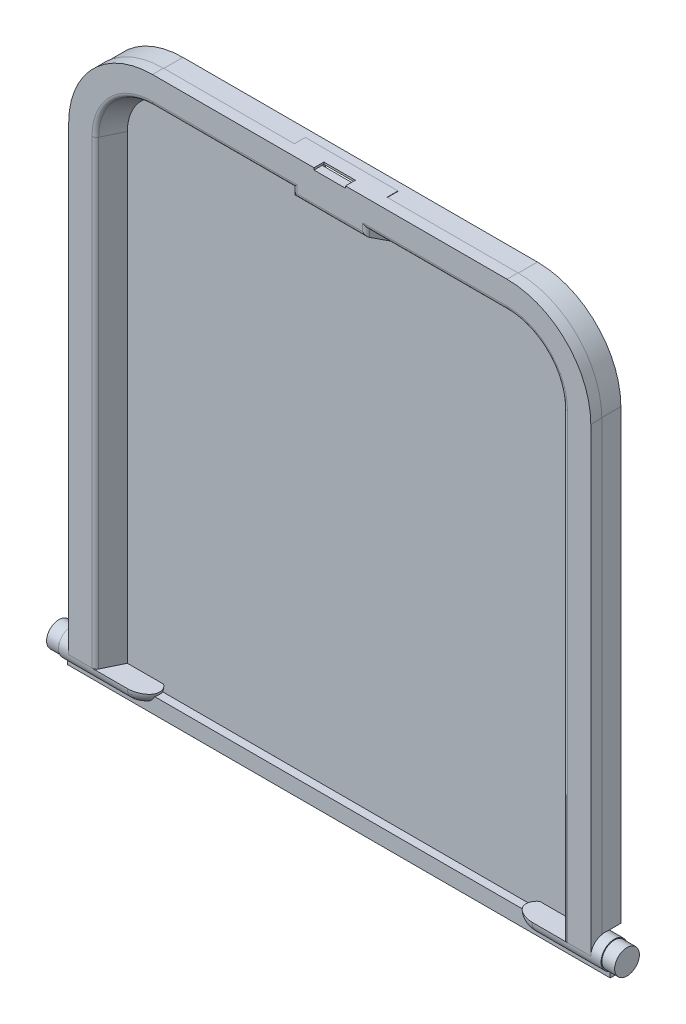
ISO-10303-21;
HEADER;
FILE_DESCRIPTION(('STEP AP214'),'2;1');
FILE_NAME('part.step','',(''),(''),'','','');
FILE_SCHEMA(('AUTOMOTIVE_DESIGN { 1 0 10303 214 1 1 1 1 }'));
ENDSEC;
DATA;
#1=APPLICATION_CONTEXT('core data for automotive mechanical design processes');
#2=APPLICATION_PROTOCOL_DEFINITION('international standard','automotive_design',2000,#1);
#3=PRODUCT_CONTEXT('',#1,'mechanical');
#4=PRODUCT('Part','Part','',(#3));
#5=PRODUCT_RELATED_PRODUCT_CATEGORY('part','',(#4));
#6=PRODUCT_DEFINITION_FORMATION('','',#4);
#7=PRODUCT_DEFINITION_CONTEXT('part definition',#1,'design');
#8=PRODUCT_DEFINITION('design','',#6,#7);
#9=PRODUCT_DEFINITION_SHAPE('','',#8);
#10=(LENGTH_UNIT() NAMED_UNIT(*) SI_UNIT(.MILLI.,.METRE.));
#11=(NAMED_UNIT(*) PLANE_ANGLE_UNIT() SI_UNIT($,.RADIAN.));
#12=(NAMED_UNIT(*) SI_UNIT($,.STERADIAN.) SOLID_ANGLE_UNIT());
#13=UNCERTAINTY_MEASURE_WITH_UNIT(LENGTH_MEASURE(1.E-05),#10,'distance_accuracy_value','');
#14=(GEOMETRIC_REPRESENTATION_CONTEXT(3) GLOBAL_UNCERTAINTY_ASSIGNED_CONTEXT((#13)) GLOBAL_UNIT_ASSIGNED_CONTEXT((#10,
#11,#12)) REPRESENTATION_CONTEXT('',''));
#15=CARTESIAN_POINT('',(0.,0.,0.));
#16=DIRECTION('',(0.,0.,1.));
#17=DIRECTION('',(1.,0.,0.));
#18=AXIS2_PLACEMENT_3D('',#15,#16,#17);
#19=CARTESIAN_POINT('',(-50.125,45.95,0.));
#20=DIRECTION('',(0.,-0.900159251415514,0.435560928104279));
#21=DIRECTION('',(0.,-0.435560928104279,-0.900159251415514));
#22=AXIS2_PLACEMENT_3D('',#19,#20,#21);
#23=PLANE('',#22);
#24=DIRECTION('',(-0.399326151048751,-0.39932615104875,-0.825274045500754));
#25=VECTOR('',#24,1.);
#26=CARTESIAN_POINT('',(-12.699220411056,43.350779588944,-5.37172218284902));
#27=LINE('',#26,#25);
#28=CARTESIAN_POINT('',(-13.1,42.95,-6.20000000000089));
#29=VERTEX_POINT('',#28);
#30=CARTESIAN_POINT('',(-10.4550503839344,45.5949496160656,-0.733770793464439));
#31=VERTEX_POINT('',#30);
#32=EDGE_CURVE('E1090',#29,#31,#27,.F.);
#33=ORIENTED_EDGE('',*,*,#32,.T.);
#34=DIRECTION('',(1.,0.,0.));
#35=VECTOR('',#34,1.);
#36=CARTESIAN_POINT('',(-50.125,45.5949496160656,-0.733770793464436));
#37=LINE('',#36,#35);
#38=CARTESIAN_POINT('',(-50.1249999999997,45.5949496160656,-0.733770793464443));
#39=VERTEX_POINT('',#38);
#40=EDGE_CURVE('E1057',#31,#39,#37,.F.);
#41=ORIENTED_EDGE('',*,*,#40,.T.);
#42=DIRECTION('',(0.,-0.435560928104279,-0.900159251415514));
#43=VECTOR('',#42,1.);
#44=CARTESIAN_POINT('',(-50.1249999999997,45.95,0.));
#45=LINE('',#44,#43);
#46=CARTESIAN_POINT('',(-50.1249999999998,42.95,-6.20000000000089));
#47=VERTEX_POINT('',#46);
#48=EDGE_CURVE('E653',#39,#47,#45,.T.);
#49=ORIENTED_EDGE('',*,*,#48,.T.);
#50=DIRECTION('',(1.,0.,0.));
#51=VECTOR('',#50,1.);
#52=CARTESIAN_POINT('',(50.125,42.95,-6.20000000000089));
#53=LINE('',#52,#51);
#54=EDGE_CURVE('E665',#47,#29,#53,.T.);
#55=ORIENTED_EDGE('',*,*,#54,.T.);
#56=EDGE_LOOP('',(#33,#41,#49,#55));
#57=FACE_BOUND('',#56,.T.);
#58=ADVANCED_FACE('F87',(#57),#23,.T.);
#59=CARTESIAN_POINT('',(-50.125,29.65,-3.1));
#60=DIRECTION('',(0.,0.,1.));
#61=DIRECTION('',(1.,0.,0.));
#62=AXIS2_PLACEMENT_3D('',#59,#60,#61);
#63=PLANE('',#62);
#64=DIRECTION('',(-1.,0.,0.));
#65=VECTOR('',#64,1.);
#66=CARTESIAN_POINT('',(21.45,53.35,-3.1));
#67=LINE('',#66,#65);
#68=CARTESIAN_POINT('',(-13.1,53.35,-3.1));
#69=VERTEX_POINT('',#68);
#70=CARTESIAN_POINT('',(-50.1249999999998,53.35,-3.1));
#71=VERTEX_POINT('',#70);
#72=EDGE_CURVE('E825',#69,#71,#67,.T.);
#73=ORIENTED_EDGE('',*,*,#72,.F.);
#74=DIRECTION('',(0.,-1.,0.));
#75=VECTOR('',#74,1.);
#76=CARTESIAN_POINT('',(-13.1,29.65,-3.1));
#77=LINE('',#76,#75);
#78=CARTESIAN_POINT('',(-13.1,53.25,-3.09999999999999));
#79=VERTEX_POINT('',#78);
#80=EDGE_CURVE('E576',#69,#79,#77,.T.);
#81=ORIENTED_EDGE('',*,*,#80,.T.);
#82=DIRECTION('',(-1.,0.,0.));
#83=VECTOR('',#82,1.);
#84=CARTESIAN_POINT('',(50.1249999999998,53.25,-3.1));
#85=LINE('',#84,#83);
#86=CARTESIAN_POINT('',(-50.1249999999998,53.25,-3.1));
#87=VERTEX_POINT('',#86);
#88=EDGE_CURVE('E587',#79,#87,#85,.T.);
#89=ORIENTED_EDGE('',*,*,#88,.T.);
#90=CARTESIAN_POINT('',(-50.125,29.65,-3.1));
#91=DIRECTION('',(0.,0.,1.));
#92=DIRECTION('',(-1.,0.,0.));
#93=AXIS2_PLACEMENT_3D('',#90,#91,#92);
#94=CIRCLE('',#93,23.6);
#95=CARTESIAN_POINT('',(-73.725,29.6499999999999,-3.1));
#96=VERTEX_POINT('',#95);
#97=EDGE_CURVE('E591',#87,#96,#94,.T.);
#98=ORIENTED_EDGE('',*,*,#97,.T.);
#99=DIRECTION('',(0.,-1.,0.));
#100=VECTOR('',#99,1.);
#101=CARTESIAN_POINT('',(-73.725,29.6499999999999,-3.1));
#102=LINE('',#101,#100);
#103=CARTESIAN_POINT('',(-73.725,-96.9067629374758,-3.1));
#104=VERTEX_POINT('',#103);
#105=EDGE_CURVE('E594',#96,#104,#102,.T.);
#106=ORIENTED_EDGE('',*,*,#105,.T.);
#107=DIRECTION('',(-1.,0.,0.));
#108=VECTOR('',#107,1.);
#109=CARTESIAN_POINT('',(-57.225,-96.9067629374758,-3.1));
#110=LINE('',#109,#108);
#111=CARTESIAN_POINT('',(-73.825,-96.9067629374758,-3.1));
#112=VERTEX_POINT('',#111);
#113=EDGE_CURVE('E774',#112,#104,#110,.F.);
#114=ORIENTED_EDGE('',*,*,#113,.F.);
#115=DIRECTION('',(0.,-1.,0.));
#116=VECTOR('',#115,1.);
#117=CARTESIAN_POINT('',(-73.825,29.6499999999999,-3.1));
#118=LINE('',#117,#116);
#119=CARTESIAN_POINT('',(-73.825,29.6499999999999,-3.1));
#120=VERTEX_POINT('',#119);
#121=EDGE_CURVE('E817',#120,#112,#118,.T.);
#122=ORIENTED_EDGE('',*,*,#121,.F.);
#123=CARTESIAN_POINT('',(-50.125,29.65,-3.1));
#124=DIRECTION('',(0.,0.,1.));
#125=DIRECTION('',(1.,0.,0.));
#126=AXIS2_PLACEMENT_3D('',#123,#124,#125);
#127=CIRCLE('',#126,23.7);
#128=EDGE_CURVE('E814',#71,#120,#127,.T.);
#129=ORIENTED_EDGE('',*,*,#128,.F.);
#130=EDGE_LOOP('',(#73,#81,#89,#98,#106,#114,#122,#129));
#131=FACE_BOUND('',#130,.T.);
#132=ADVANCED_FACE('F1212',(#131),#63,.F.);
#133=CARTESIAN_POINT('',(66.325,-100.6,0.));
#134=DIRECTION('',(0.,-1.,0.));
#135=DIRECTION('',(0.,0.,-1.));
#136=AXIS2_PLACEMENT_3D('',#133,#134,#135);
#137=PLANE('',#136);
#138=DIRECTION('',(-1.,0.,0.));
#139=VECTOR('',#138,1.);
#140=CARTESIAN_POINT('',(66.325,-100.6,0.));
#141=LINE('',#140,#139);
#142=CARTESIAN_POINT('',(67.2401566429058,-100.6,0.));
#143=VERTEX_POINT('',#142);
#144=CARTESIAN_POINT('',(57.225,-100.6,0.));
#145=VERTEX_POINT('',#144);
#146=EDGE_CURVE('E1025',#143,#145,#141,.T.);
#147=ORIENTED_EDGE('',*,*,#146,.F.);
#148=CARTESIAN_POINT('',(67.2401566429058,-100.6,-1.3));
#149=DIRECTION('',(0.,-1.,0.));
#150=DIRECTION('',(0.,0.,-1.));
#151=AXIS2_PLACEMENT_3D('',#148,#149,#150);
#152=CIRCLE('',#151,1.3);
#153=CARTESIAN_POINT('',(66.0699496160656,-100.6,-0.733770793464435));
#154=VERTEX_POINT('',#153);
#155=EDGE_CURVE('E13',#143,#154,#152,.T.);
#156=ORIENTED_EDGE('',*,*,#155,.T.);
#157=DIRECTION('',(-0.43556092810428,0.,-0.900159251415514));
#158=VECTOR('',#157,1.);
#159=CARTESIAN_POINT('',(66.4060286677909,-100.6,-0.0392074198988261));
#160=LINE('',#159,#158);
#161=CARTESIAN_POINT('',(63.425,-100.6,-6.20000000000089));
#162=VERTEX_POINT('',#161);
#163=EDGE_CURVE('E946',#154,#162,#160,.T.);
#164=ORIENTED_EDGE('',*,*,#163,.T.);
#165=DIRECTION('',(-1.,0.,0.));
#166=VECTOR('',#165,1.);
#167=CARTESIAN_POINT('',(66.325,-100.6,-6.20000000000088));
#168=LINE('',#167,#166);
#169=CARTESIAN_POINT('',(53.1769660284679,-100.6,-6.20000000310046));
#170=VERTEX_POINT('',#169);
#171=EDGE_CURVE('E717',#162,#170,#168,.T.);
#172=ORIENTED_EDGE('',*,*,#171,.T.);
#173=CARTESIAN_POINT('',(57.225,-100.6,-7.50000000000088));
#174=CARTESIAN_POINT('',(55.0335392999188,-100.6,-7.50000000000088));
#175=CARTESIAN_POINT('',(51.825,-100.6,-6.21765194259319));
#176=CARTESIAN_POINT('',(51.825,-100.6,-3.75000000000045));
#177=B_SPLINE_CURVE_WITH_KNOTS('',3,(#173,#174,#175,#176),.UNSPECIFIED.,.F.,.F.,(4,4),(0.,1.),.UNSPECIFIED.);
#178=CARTESIAN_POINT('',(51.825,-100.6,-3.75000000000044));
#179=VERTEX_POINT('',#178);
#180=EDGE_CURVE('E849',#170,#179,#177,.T.);
#181=ORIENTED_EDGE('',*,*,#180,.T.);
#182=CARTESIAN_POINT('',(57.225,-100.6,0.));
#183=CARTESIAN_POINT('',(55.0335392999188,-100.6,0.));
#184=CARTESIAN_POINT('',(51.825,-100.6,-1.28234805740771));
#185=CARTESIAN_POINT('',(51.825,-100.6,-3.75000000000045));
#186=B_SPLINE_CURVE_WITH_KNOTS('',3,(#182,#183,#184,#185),.UNSPECIFIED.,.F.,.F.,(4,4),(0.,1.),.UNSPECIFIED.);
#187=EDGE_CURVE('E844',#179,#145,#186,.F.);
#188=ORIENTED_EDGE('',*,*,#187,.T.);
#189=EDGE_LOOP('',(#147,#156,#164,#172,#181,#188));
#190=FACE_BOUND('',#189,.T.);
#191=ADVANCED_FACE('F753',(#190),#137,.F.);
#192=CARTESIAN_POINT('',(-66.325,-100.6,0.));
#193=DIRECTION('',(0.,1.,0.));
#194=DIRECTION('',(0.,0.,1.));
#195=AXIS2_PLACEMENT_3D('',#192,#193,#194);
#196=PLANE('',#195);
#197=DIRECTION('',(1.,0.,0.));
#198=VECTOR('',#197,1.);
#199=CARTESIAN_POINT('',(-66.325,-100.6,-6.2000000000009));
#200=LINE('',#199,#198);
#201=CARTESIAN_POINT('',(-63.425,-100.6,-6.20000000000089));
#202=VERTEX_POINT('',#201);
#203=CARTESIAN_POINT('',(-53.1769660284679,-100.6,-6.20000000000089));
#204=VERTEX_POINT('',#203);
#205=EDGE_CURVE('E938',#202,#204,#200,.T.);
#206=ORIENTED_EDGE('',*,*,#205,.F.);
#207=DIRECTION('',(-0.435560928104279,0.,0.900159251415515));
#208=VECTOR('',#207,1.);
#209=CARTESIAN_POINT('',(-66.425,-100.6,0.));
#210=LINE('',#209,#208);
#211=CARTESIAN_POINT('',(-66.0699496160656,-100.6,-0.733770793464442));
#212=VERTEX_POINT('',#211);
#213=EDGE_CURVE('E1110',#202,#212,#210,.T.);
#214=ORIENTED_EDGE('',*,*,#213,.T.);
#215=CARTESIAN_POINT('',(-67.2401566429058,-100.6,-1.3));
#216=DIRECTION('',(0.,1.,0.));
#217=DIRECTION('',(0.,0.,1.));
#218=AXIS2_PLACEMENT_3D('',#215,#216,#217);
#219=CIRCLE('',#218,1.3);
#220=CARTESIAN_POINT('',(-67.2401566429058,-100.6,0.));
#221=VERTEX_POINT('',#220);
#222=EDGE_CURVE('E95',#212,#221,#219,.F.);
#223=ORIENTED_EDGE('',*,*,#222,.T.);
#224=DIRECTION('',(1.,0.,0.));
#225=VECTOR('',#224,1.);
#226=CARTESIAN_POINT('',(-66.325,-100.6,0.));
#227=LINE('',#226,#225);
#228=CARTESIAN_POINT('',(-57.225,-100.6,0.));
#229=VERTEX_POINT('',#228);
#230=EDGE_CURVE('E1017',#221,#229,#227,.T.);
#231=ORIENTED_EDGE('',*,*,#230,.T.);
#232=CARTESIAN_POINT('',(-57.225,-100.6,0.));
#233=CARTESIAN_POINT('',(-55.0335392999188,-100.6,0.));
#234=CARTESIAN_POINT('',(-51.825,-100.6,-1.28234805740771));
#235=CARTESIAN_POINT('',(-51.825,-100.6,-3.75000000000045));
#236=B_SPLINE_CURVE_WITH_KNOTS('',3,(#232,#233,#234,#235),.UNSPECIFIED.,.F.,.F.,(4,4),(0.,1.),.UNSPECIFIED.);
#237=CARTESIAN_POINT('',(-51.825,-100.6,-3.75000000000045));
#238=VERTEX_POINT('',#237);
#239=EDGE_CURVE('E861',#238,#229,#236,.F.);
#240=ORIENTED_EDGE('',*,*,#239,.F.);
#241=CARTESIAN_POINT('',(-57.225,-100.6,-7.50000000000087));
#242=CARTESIAN_POINT('',(-55.0335392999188,-100.6,-7.50000000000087));
#243=CARTESIAN_POINT('',(-51.825,-100.6,-6.21765194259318));
#244=CARTESIAN_POINT('',(-51.825,-100.6,-3.75000000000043));
#245=B_SPLINE_CURVE_WITH_KNOTS('',3,(#241,#242,#243,#244),.UNSPECIFIED.,.F.,.F.,(4,4),(0.,1.),.UNSPECIFIED.);
#246=EDGE_CURVE('E866',#204,#238,#245,.T.);
#247=ORIENTED_EDGE('',*,*,#246,.F.);
#248=EDGE_LOOP('',(#206,#214,#223,#231,#240,#247));
#249=FACE_BOUND('',#248,.T.);
#250=ADVANCED_FACE('F730',(#249),#196,.T.);
#251=CARTESIAN_POINT('',(66.325,178.523556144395,-6.20000000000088));
#252=DIRECTION('',(0.,0.,1.));
#253=DIRECTION('',(1.,0.,0.));
#254=AXIS2_PLACEMENT_3D('',#251,#252,#253);
#255=PLANE('',#254);
#256=DIRECTION('',(0.,1.,0.));
#257=VECTOR('',#256,1.);
#258=CARTESIAN_POINT('',(-13.1,42.95,-6.20000000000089));
#259=LINE('',#258,#257);
#260=CARTESIAN_POINT('',(-13.1,40.75,-6.20000000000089));
#261=VERTEX_POINT('',#260);
#262=EDGE_CURVE('E559',#261,#29,#259,.T.);
#263=ORIENTED_EDGE('',*,*,#262,.T.);
#264=ORIENTED_EDGE('',*,*,#54,.F.);
#265=CARTESIAN_POINT('',(-50.125,29.65,-6.20000000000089));
#266=DIRECTION('',(0.,0.,-1.));
#267=DIRECTION('',(1.,0.,0.));
#268=AXIS2_PLACEMENT_3D('',#265,#266,#267);
#269=CIRCLE('',#268,13.3);
#270=CARTESIAN_POINT('',(-63.425,29.6499999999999,-6.20000000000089));
#271=VERTEX_POINT('',#270);
#272=EDGE_CURVE('E669',#271,#47,#269,.T.);
#273=ORIENTED_EDGE('',*,*,#272,.F.);
#274=DIRECTION('',(0.,1.,0.));
#275=VECTOR('',#274,1.);
#276=CARTESIAN_POINT('',(-63.425,29.6499999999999,-6.20000000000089));
#277=LINE('',#276,#275);
#278=EDGE_CURVE('E657',#202,#271,#277,.T.);
#279=ORIENTED_EDGE('',*,*,#278,.F.);
#280=ORIENTED_EDGE('',*,*,#205,.T.);
#281=CARTESIAN_POINT('',(-53.1769660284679,-100.6,-6.2000000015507));
#282=CARTESIAN_POINT('',(-53.1769415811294,-100.660393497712,-6.20000000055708));
#283=CARTESIAN_POINT('',(-53.1799047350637,-100.720773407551,-6.20000000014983));
#284=CARTESIAN_POINT('',(-53.1916178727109,-100.840914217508,-6.1999999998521));
#285=CARTESIAN_POINT('',(-53.2003624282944,-100.900675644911,-6.19999999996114));
#286=CARTESIAN_POINT('',(-53.2233323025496,-101.018495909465,-6.20000000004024));
#287=CARTESIAN_POINT('',(-53.2375005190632,-101.076565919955,-6.2000000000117));
#288=CARTESIAN_POINT('',(-53.270989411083,-101.191191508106,-6.19999999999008));
#289=CARTESIAN_POINT('',(-53.2903109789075,-101.247746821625,-6.19999999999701));
#290=CARTESIAN_POINT('',(-53.3552822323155,-101.414172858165,-6.20000000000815));
#291=CARTESIAN_POINT('',(-53.4080461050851,-101.521329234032,-6.20000000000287));
#292=CARTESIAN_POINT('',(-53.5291456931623,-101.726618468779,-6.19999999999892));
#293=CARTESIAN_POINT('',(-53.5975275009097,-101.824723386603,-6.20000000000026));
#294=CARTESIAN_POINT('',(-53.7842739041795,-102.058512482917,-6.20000000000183));
#295=CARTESIAN_POINT('',(-53.910389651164,-102.187991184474,-6.20000000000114));
#296=CARTESIAN_POINT('',(-54.1812080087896,-102.4255398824,-6.20000000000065));
#297=CARTESIAN_POINT('',(-54.3259353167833,-102.533580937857,-6.20000000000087));
#298=CARTESIAN_POINT('',(-54.5227340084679,-102.661642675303,-6.20000000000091));
#299=CARTESIAN_POINT('',(-54.569204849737,-102.690599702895,-6.2000000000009));
#300=CARTESIAN_POINT('',(-54.6630212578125,-102.746647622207,-6.20000000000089));
#301=CARTESIAN_POINT('',(-54.7103628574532,-102.773745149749,-6.20000000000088));
#302=CARTESIAN_POINT('',(-54.7581822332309,-102.8,-6.20000000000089));
#303=B_SPLINE_CURVE_WITH_KNOTS('',3,(#281,#282,#283,#284,#285,#286,#287,#288,#289,#290,#291,
#292,#293,#294,#295,#296,#297,#298,#299,#300,#301,#302),.UNSPECIFIED.,.F.,.F.,(4,2,2,2,2,2,2,2,
2,2,4),(0.,0.18108583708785,0.362001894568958,0.541063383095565,0.720155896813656,
1.07675352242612,1.43441747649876,1.97365020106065,2.51360601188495,2.67784767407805,
2.84146894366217),.UNSPECIFIED.);
#304=CARTESIAN_POINT('',(-54.758182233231,-102.8,-6.2000000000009));
#305=VERTEX_POINT('',#304);
#306=EDGE_CURVE('E709',#204,#305,#303,.T.);
#307=ORIENTED_EDGE('',*,*,#306,.T.);
#308=DIRECTION('',(-1.,0.,0.));
#309=VECTOR('',#308,1.);
#310=CARTESIAN_POINT('',(66.325,-102.8,-6.20000000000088));
#311=LINE('',#310,#309);
#312=CARTESIAN_POINT('',(54.7581822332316,-102.8,-6.20000000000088));
#313=VERTEX_POINT('',#312);
#314=EDGE_CURVE('E692',#313,#305,#311,.T.);
#315=ORIENTED_EDGE('',*,*,#314,.F.);
#316=CARTESIAN_POINT('',(54.7581822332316,-102.8,-6.20000000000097));
#317=CARTESIAN_POINT('',(54.6716283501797,-102.752454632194,-6.20000000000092));
#318=CARTESIAN_POINT('',(54.5865420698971,-102.702133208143,-6.20000000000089));
#319=CARTESIAN_POINT('',(54.4199158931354,-102.595488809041,-6.20000000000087));
#320=CARTESIAN_POINT('',(54.3383857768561,-102.539150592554,-6.20000000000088));
#321=CARTESIAN_POINT('',(54.1788786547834,-102.419469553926,-6.20000000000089));
#322=CARTESIAN_POINT('',(54.1009639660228,-102.356042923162,-6.20000000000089));
#323=CARTESIAN_POINT('',(53.9511458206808,-102.22258761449,-6.20000000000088));
#324=CARTESIAN_POINT('',(53.8792358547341,-102.152566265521,-6.20000000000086));
#325=CARTESIAN_POINT('',(53.7213811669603,-101.982590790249,-6.20000000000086));
#326=CARTESIAN_POINT('',(53.6380836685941,-101.880125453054,-6.20000000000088));
#327=CARTESIAN_POINT('',(53.4886074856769,-101.663841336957,-6.20000000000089));
#328=CARTESIAN_POINT('',(53.4223576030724,-101.550072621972,-6.20000000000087));
#329=CARTESIAN_POINT('',(53.3199799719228,-101.330979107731,-6.20000000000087));
#330=CARTESIAN_POINT('',(53.2807587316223,-101.22712505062,-6.20000000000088));
#331=CARTESIAN_POINT('',(53.2353358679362,-101.067662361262,-6.20000000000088));
#332=CARTESIAN_POINT('',(53.222431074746,-101.013906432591,-6.20000000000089));
#333=CARTESIAN_POINT('',(53.2013076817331,-100.905490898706,-6.20000000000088));
#334=CARTESIAN_POINT('',(53.1930865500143,-100.850831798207,-6.20000000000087));
#335=CARTESIAN_POINT('',(53.1838558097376,-100.763375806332,-6.20000000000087));
#336=CARTESIAN_POINT('',(53.1812728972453,-100.730736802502,-6.20000000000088));
#337=CARTESIAN_POINT('',(53.1778282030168,-100.665400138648,-6.20000000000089));
#338=CARTESIAN_POINT('',(53.1769647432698,-100.632702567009,-6.20000000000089));
#339=CARTESIAN_POINT('',(53.1769660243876,-100.600000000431,-6.20000000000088));
#340=B_SPLINE_CURVE_WITH_KNOTS('',3,(#316,#317,#318,#319,#320,#321,#322,#323,#324,#325,#326,
#327,#328,#329,#330,#331,#332,#333,#334,#335,#336,#337,#338,#339),.UNSPECIFIED.,.F.,.F.,(4,2,2,
2,2,2,2,2,2,2,2,4),(0.,0.296282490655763,0.593334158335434,0.894369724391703,1.19507460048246,
1.58985305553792,1.98295496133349,2.31445309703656,2.48013124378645,2.6457197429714,
2.7439021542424,2.8419887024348),.UNSPECIFIED.);
#341=EDGE_CURVE('E736',#313,#170,#340,.T.);
#342=ORIENTED_EDGE('',*,*,#341,.T.);
#343=ORIENTED_EDGE('',*,*,#171,.F.);
#344=DIRECTION('',(0.,-1.,0.));
#345=VECTOR('',#344,1.);
#346=CARTESIAN_POINT('',(63.425,-100.6,-6.20000000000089));
#347=LINE('',#346,#345);
#348=CARTESIAN_POINT('',(63.425,29.6499999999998,-6.20000000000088));
#349=VERTEX_POINT('',#348);
#350=EDGE_CURVE('E658',#349,#162,#347,.T.);
#351=ORIENTED_EDGE('',*,*,#350,.F.);
#352=CARTESIAN_POINT('',(50.125,29.65,-6.20000000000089));
#353=DIRECTION('',(0.,0.,-1.));
#354=DIRECTION('',(1.,0.,0.));
#355=AXIS2_PLACEMENT_3D('',#352,#353,#354);
#356=CIRCLE('',#355,13.3);
#357=CARTESIAN_POINT('',(50.125,42.95,-6.20000000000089));
#358=VERTEX_POINT('',#357);
#359=EDGE_CURVE('E662',#358,#349,#356,.T.);
#360=ORIENTED_EDGE('',*,*,#359,.F.);
#361=CARTESIAN_POINT('',(13.1,42.95,-6.20000000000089));
#362=VERTEX_POINT('',#361);
#363=EDGE_CURVE('E668',#362,#358,#53,.T.);
#364=ORIENTED_EDGE('',*,*,#363,.F.);
#365=DIRECTION('',(0.,1.,0.));
#366=VECTOR('',#365,1.);
#367=CARTESIAN_POINT('',(13.1,42.95,-6.20000000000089));
#368=LINE('',#367,#366);
#369=CARTESIAN_POINT('',(13.1,40.75,-6.20000000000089));
#370=VERTEX_POINT('',#369);
#371=EDGE_CURVE('E555',#370,#362,#368,.T.);
#372=ORIENTED_EDGE('',*,*,#371,.F.);
#373=DIRECTION('',(1.,0.,0.));
#374=VECTOR('',#373,1.);
#375=CARTESIAN_POINT('',(-19.9876701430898,40.75,-6.20000000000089));
#376=LINE('',#375,#374);
#377=EDGE_CURVE('E558',#261,#370,#376,.T.);
#378=ORIENTED_EDGE('',*,*,#377,.F.);
#379=EDGE_LOOP('',(#263,#264,#273,#279,#280,#307,#315,#342,#343,#351,#360,#364,#372,#378));
#380=FACE_BOUND('',#379,.T.);
#381=ADVANCED_FACE('F724',(#380),#255,.T.);
#382=CARTESIAN_POINT('',(-66.325,178.523556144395,-6.2000000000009));
#383=DIRECTION('',(-1.,0.,0.));
#384=DIRECTION('',(0.,0.,1.));
#385=AXIS2_PLACEMENT_3D('',#382,#383,#384);
#386=PLANE('',#385);
#387=DIRECTION('',(0.,0.,1.));
#388=VECTOR('',#387,1.);
#389=CARTESIAN_POINT('',(-66.325,-96.9067629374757,-6.2000000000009));
#390=LINE('',#389,#388);
#391=CARTESIAN_POINT('',(-66.325,-96.9067629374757,-8.60000000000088));
#392=VERTEX_POINT('',#391);
#393=CARTESIAN_POINT('',(-66.325,-96.9067629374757,-4.40000000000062));
#394=VERTEX_POINT('',#393);
#395=EDGE_CURVE('E647',#392,#394,#390,.T.);
#396=ORIENTED_EDGE('',*,*,#395,.F.);
#397=DIRECTION('',(0.,-1.,0.));
#398=VECTOR('',#397,1.);
#399=CARTESIAN_POINT('',(-66.325,178.523556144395,-8.6000000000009));
#400=LINE('',#399,#398);
#401=CARTESIAN_POINT('',(-66.325,29.65,-8.6000000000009));
#402=VERTEX_POINT('',#401);
#403=EDGE_CURVE('E629',#402,#392,#400,.T.);
#404=ORIENTED_EDGE('',*,*,#403,.F.);
#405=DIRECTION('',(0.,0.,1.));
#406=VECTOR('',#405,1.);
#407=CARTESIAN_POINT('',(-66.325,29.6499999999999,-8.7000000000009));
#408=LINE('',#407,#406);
#409=CARTESIAN_POINT('',(-66.325,29.6499999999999,-8.7000000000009));
#410=VERTEX_POINT('',#409);
#411=EDGE_CURVE('E676',#410,#402,#408,.T.);
#412=ORIENTED_EDGE('',*,*,#411,.F.);
#413=DIRECTION('',(0.,-1.,0.));
#414=VECTOR('',#413,1.);
#415=CARTESIAN_POINT('',(-66.325,178.523556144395,-8.7000000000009));
#416=LINE('',#415,#414);
#417=CARTESIAN_POINT('',(-66.325,-102.8,-8.7000000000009));
#418=VERTEX_POINT('',#417);
#419=EDGE_CURVE('E707',#410,#418,#416,.T.);
#420=ORIENTED_EDGE('',*,*,#419,.T.);
#421=DIRECTION('',(0.,0.,-1.));
#422=VECTOR('',#421,1.);
#423=CARTESIAN_POINT('',(-66.325,-102.8,-6.2000000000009));
#424=LINE('',#423,#422);
#425=CARTESIAN_POINT('',(-66.325,-102.8,-6.78685692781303));
#426=VERTEX_POINT('',#425);
#427=EDGE_CURVE('E689',#426,#418,#424,.T.);
#428=ORIENTED_EDGE('',*,*,#427,.F.);
#429=CARTESIAN_POINT('',(-66.325,-100.6,-3.75000000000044));
#430=DIRECTION('',(1.,0.,0.));
#431=DIRECTION('',(0.,0.,-1.));
#432=AXIS2_PLACEMENT_3D('',#429,#430,#431);
#433=CIRCLE('',#432,3.75000000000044);
#434=EDGE_CURVE('E873',#426,#394,#433,.T.);
#435=ORIENTED_EDGE('',*,*,#434,.T.);
#436=EDGE_LOOP('',(#396,#404,#412,#420,#428,#435));
#437=FACE_BOUND('',#436,.T.);
#438=ADVANCED_FACE('F729',(#437),#386,.T.);
#439=CARTESIAN_POINT('',(-50.1249999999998,45.85,-3.1));
#440=DIRECTION('',(0.,1.,0.));
#441=DIRECTION('',(0.,0.,1.));
#442=AXIS2_PLACEMENT_3D('',#439,#440,#441);
#443=PLANE('',#442);
#444=DIRECTION('',(-1.,0.,0.));
#445=VECTOR('',#444,1.);
#446=CARTESIAN_POINT('',(-50.1249999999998,45.85,-8.60000000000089));
#447=LINE('',#446,#445);
#448=CARTESIAN_POINT('',(50.125,45.85,-8.60000000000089));
#449=VERTEX_POINT('',#448);
#450=CARTESIAN_POINT('',(9.71076712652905,45.85,-8.60000000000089));
#451=VERTEX_POINT('',#450);
#452=EDGE_CURVE('E626',#449,#451,#447,.T.);
#453=ORIENTED_EDGE('',*,*,#452,.F.);
#454=DIRECTION('',(0.,0.,1.));
#455=VECTOR('',#454,1.);
#456=CARTESIAN_POINT('',(50.1249999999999,45.85,-8.7000000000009));
#457=LINE('',#456,#455);
#458=CARTESIAN_POINT('',(50.1249999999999,45.85,-8.7000000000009));
#459=VERTEX_POINT('',#458);
#460=EDGE_CURVE('E685',#459,#449,#457,.T.);
#461=ORIENTED_EDGE('',*,*,#460,.F.);
#462=DIRECTION('',(1.,0.,0.));
#463=VECTOR('',#462,1.);
#464=CARTESIAN_POINT('',(66.325,45.85,-8.70000000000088));
#465=LINE('',#464,#463);
#466=CARTESIAN_POINT('',(-50.1249999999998,45.85,-8.7000000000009));
#467=VERTEX_POINT('',#466);
#468=EDGE_CURVE('E695',#467,#459,#465,.T.);
#469=ORIENTED_EDGE('',*,*,#468,.F.);
#470=DIRECTION('',(0.,0.,1.));
#471=VECTOR('',#470,1.);
#472=CARTESIAN_POINT('',(-50.1249999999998,45.85,-8.7000000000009));
#473=LINE('',#472,#471);
#474=CARTESIAN_POINT('',(-50.1249999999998,45.85,-8.6000000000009));
#475=VERTEX_POINT('',#474);
#476=EDGE_CURVE('E677',#467,#475,#473,.T.);
#477=ORIENTED_EDGE('',*,*,#476,.T.);
#478=CARTESIAN_POINT('',(-9.73961286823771,45.85,-8.60000000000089));
#479=VERTEX_POINT('',#478);
#480=EDGE_CURVE('E597',#479,#475,#447,.T.);
#481=ORIENTED_EDGE('',*,*,#480,.F.);
#482=EDGE_CURVE('E630',#451,#479,#447,.T.);
#483=ORIENTED_EDGE('',*,*,#482,.F.);
#484=EDGE_LOOP('',(#453,#461,#469,#477,#481,#483));
#485=FACE_BOUND('',#484,.T.);
#486=ADVANCED_FACE('F899',(#485),#443,.T.);
#487=CARTESIAN_POINT('',(-57.225,-100.6,-3.75000000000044));
#488=DIRECTION('',(-1.,0.,0.));
#489=DIRECTION('',(0.,0.,1.));
#490=AXIS2_PLACEMENT_3D('',#487,#488,#489);
#491=CYLINDRICAL_SURFACE('',#490,3.75000000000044);
#492=CARTESIAN_POINT('',(-73.725,-100.6,-3.75000000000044));
#493=DIRECTION('',(-1.,0.,0.));
#494=DIRECTION('',(0.,0.,1.));
#495=AXIS2_PLACEMENT_3D('',#492,#493,#494);
#496=CIRCLE('',#495,3.75000000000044);
#497=CARTESIAN_POINT('',(-73.725,-96.9067629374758,-4.40000000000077));
#498=VERTEX_POINT('',#497);
#499=EDGE_CURVE('E641',#104,#498,#496,.T.);
#500=ORIENTED_EDGE('',*,*,#499,.T.);
#501=DIRECTION('',(-1.,0.,0.));
#502=VECTOR('',#501,1.);
#503=CARTESIAN_POINT('',(-57.225,-96.9067629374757,-4.40000000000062));
#504=LINE('',#503,#502);
#505=EDGE_CURVE('E644',#498,#394,#504,.F.);
#506=ORIENTED_EDGE('',*,*,#505,.T.);
#507=ORIENTED_EDGE('',*,*,#434,.F.);
#508=DIRECTION('',(-1.,0.,0.));
#509=VECTOR('',#508,1.);
#510=CARTESIAN_POINT('',(-57.225,-102.8,-6.78685692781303));
#511=LINE('',#510,#509);
#512=CARTESIAN_POINT('',(-57.225,-102.8,-6.78685692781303));
#513=VERTEX_POINT('',#512);
#514=EDGE_CURVE('E962',#513,#426,#511,.T.);
#515=ORIENTED_EDGE('',*,*,#514,.F.);
#516=CARTESIAN_POINT('',(-57.225,-100.6,-3.75000000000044));
#517=DIRECTION('',(1.,0.,0.));
#518=DIRECTION('',(0.,0.,-1.));
#519=AXIS2_PLACEMENT_3D('',#516,#517,#518);
#520=CIRCLE('',#519,3.75000000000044);
#521=CARTESIAN_POINT('',(-57.225,-104.169313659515,-4.90000000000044));
#522=VERTEX_POINT('',#521);
#523=EDGE_CURVE('E770',#522,#513,#520,.T.);
#524=ORIENTED_EDGE('',*,*,#523,.F.);
#525=DIRECTION('',(-1.,0.,0.));
#526=VECTOR('',#525,1.);
#527=CARTESIAN_POINT('',(-57.225,-104.169313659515,-4.90000000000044));
#528=LINE('',#527,#526);
#529=CARTESIAN_POINT('',(-76.725,-104.169313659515,-4.90000000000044));
#530=VERTEX_POINT('',#529);
#531=EDGE_CURVE('E911',#522,#530,#528,.T.);
#532=ORIENTED_EDGE('',*,*,#531,.T.);
#533=CARTESIAN_POINT('',(-76.725,-100.6,-3.75000000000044));
#534=DIRECTION('',(1.,0.,0.));
#535=DIRECTION('',(0.,0.,-1.));
#536=AXIS2_PLACEMENT_3D('',#533,#534,#535);
#537=CIRCLE('',#536,3.75000000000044);
#538=CARTESIAN_POINT('',(-76.725,-104.169313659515,-2.60000000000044));
#539=VERTEX_POINT('',#538);
#540=EDGE_CURVE('E765',#530,#539,#537,.T.);
#541=ORIENTED_EDGE('',*,*,#540,.T.);
#542=DIRECTION('',(-1.,0.,0.));
#543=VECTOR('',#542,1.);
#544=CARTESIAN_POINT('',(-57.225,-104.169313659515,-2.60000000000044));
#545=LINE('',#544,#543);
#546=CARTESIAN_POINT('',(-57.225,-104.169313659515,-2.60000000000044));
#547=VERTEX_POINT('',#546);
#548=EDGE_CURVE('E924',#539,#547,#545,.F.);
#549=ORIENTED_EDGE('',*,*,#548,.T.);
#550=EDGE_CURVE('E771',#229,#547,#520,.T.);
#551=ORIENTED_EDGE('',*,*,#550,.F.);
#552=ORIENTED_EDGE('',*,*,#230,.F.);
#553=CARTESIAN_POINT('',(-73.825,-100.6,0.));
#554=VERTEX_POINT('',#553);
#555=EDGE_CURVE('E1019',#554,#221,#227,.T.);
#556=ORIENTED_EDGE('',*,*,#555,.F.);
#557=CARTESIAN_POINT('',(-73.825,-100.6,-3.75000000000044));
#558=DIRECTION('',(-1.,0.,0.));
#559=DIRECTION('',(0.,0.,1.));
#560=AXIS2_PLACEMENT_3D('',#557,#558,#559);
#561=CIRCLE('',#560,3.75000000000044);
#562=EDGE_CURVE('E777',#112,#554,#561,.F.);
#563=ORIENTED_EDGE('',*,*,#562,.F.);
#564=ORIENTED_EDGE('',*,*,#113,.T.);
#565=EDGE_LOOP('',(#500,#506,#507,#515,#524,#532,#541,#549,#551,#552,#556,#563,#564));
#566=FACE_BOUND('',#565,.T.);
#567=ADVANCED_FACE('F1011',(#566),#491,.T.);
#568=CARTESIAN_POINT('',(-57.225,-96.8499999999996,-3.75000000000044));
#569=CARTESIAN_POINT('',(-55.0335392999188,-96.8499999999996,-3.75000000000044));
#570=CARTESIAN_POINT('',(-51.825,-98.1323480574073,-3.75000000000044));
#571=CARTESIAN_POINT('',(-51.825,-100.6,-3.75000000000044));
#572=B_SPLINE_CURVE_WITH_KNOTS('',3,(#568,#569,#570,#571),.UNSPECIFIED.,.F.,.F.,(4,4),(0.,1.),.UNSPECIFIED.);
#573=CARTESIAN_POINT('',(-57.225,-100.6,-3.75000000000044));
#574=DIRECTION('',(-1.,0.,0.));
#575=AXIS1_PLACEMENT('',#573,#574);
#576=SURFACE_OF_REVOLUTION('',#572,#575);
#577=ORIENTED_EDGE('',*,*,#523,.T.);
#578=CARTESIAN_POINT('',(-57.225,-102.8,-6.78685692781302));
#579=CARTESIAN_POINT('',(-57.1620202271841,-102.8,-6.78685034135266));
#580=CARTESIAN_POINT('',(-57.0990513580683,-102.8,-6.7855497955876));
#581=CARTESIAN_POINT('',(-56.9732229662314,-102.8,-6.78052195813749));
#582=CARTESIAN_POINT('',(-56.910363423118,-102.8,-6.7767951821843));
#583=CARTESIAN_POINT('',(-56.7229689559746,-102.8,-6.76228820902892));
#584=CARTESIAN_POINT('',(-56.5986841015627,-102.8,-6.74817626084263));
#585=CARTESIAN_POINT('',(-56.3276068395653,-102.8,-6.70835253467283));
#586=CARTESIAN_POINT('',(-56.181066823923,-102.8,-6.68093572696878));
#587=CARTESIAN_POINT('',(-55.8903899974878,-102.8,-6.61526448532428));
#588=CARTESIAN_POINT('',(-55.7462541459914,-102.8,-6.57700582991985));
#589=CARTESIAN_POINT('',(-55.4586902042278,-102.8,-6.48905495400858));
#590=CARTESIAN_POINT('',(-55.3153198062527,-102.8,-6.43917233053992));
#591=CARTESIAN_POINT('',(-55.1036359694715,-102.8,-6.35591883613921));
#592=CARTESIAN_POINT('',(-55.0336429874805,-102.8,-6.32676584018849));
#593=CARTESIAN_POINT('',(-54.8949223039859,-102.8,-6.26556935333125));
#594=CARTESIAN_POINT('',(-54.8261947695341,-102.8,-6.23352548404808));
#595=CARTESIAN_POINT('',(-54.7581822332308,-102.8,-6.20000000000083));
#596=B_SPLINE_CURVE_WITH_KNOTS('',3,(#578,#579,#580,#581,#582,#583,#584,#585,#586,#587,#588,
#589,#590,#591,#592,#593,#594,#595),.UNSPECIFIED.,.F.,.F.,(4,2,2,2,2,2,2,2,4),(0.,
0.188908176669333,0.377776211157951,0.752716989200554,1.19953032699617,1.64651787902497,
2.10141777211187,2.32882552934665,2.55626309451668),.UNSPECIFIED.);
#597=EDGE_CURVE('E957',#513,#305,#596,.T.);
#598=ORIENTED_EDGE('',*,*,#597,.T.);
#599=ORIENTED_EDGE('',*,*,#306,.F.);
#600=ORIENTED_EDGE('',*,*,#246,.T.);
#601=ORIENTED_EDGE('',*,*,#239,.T.);
#602=ORIENTED_EDGE('',*,*,#550,.T.);
#603=CARTESIAN_POINT('',(-52.1811192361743,-101.3,-2.60000000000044));
#604=CARTESIAN_POINT('',(-52.2047115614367,-101.380481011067,-2.60000000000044));
#605=CARTESIAN_POINT('',(-52.2323270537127,-101.459737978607,-2.60000000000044));
#606=CARTESIAN_POINT('',(-52.2949040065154,-101.615156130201,-2.60000000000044));
#607=CARTESIAN_POINT('',(-52.3298536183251,-101.691322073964,-2.60000000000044));
#608=CARTESIAN_POINT('',(-52.4059780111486,-101.839200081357,-2.60000000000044));
#609=CARTESIAN_POINT('',(-52.4470655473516,-101.910957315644,-2.60000000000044));
#610=CARTESIAN_POINT('',(-52.5350895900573,-102.050817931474,-2.60000000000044));
#611=CARTESIAN_POINT('',(-52.5820288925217,-102.118919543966,-2.60000000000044));
#612=CARTESIAN_POINT('',(-52.6947060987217,-102.269564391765,-2.60000000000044));
#613=CARTESIAN_POINT('',(-52.7620558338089,-102.350902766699,-2.60000000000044));
#614=CARTESIAN_POINT('',(-52.9037357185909,-102.507312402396,-2.60000000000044));
#615=CARTESIAN_POINT('',(-52.9780712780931,-102.582378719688,-2.60000000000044));
#616=CARTESIAN_POINT('',(-53.1329096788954,-102.726759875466,-2.60000000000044));
#617=CARTESIAN_POINT('',(-53.2134455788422,-102.796039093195,-2.60000000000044));
#618=CARTESIAN_POINT('',(-53.3792413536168,-102.928604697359,-2.60000000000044));
#619=CARTESIAN_POINT('',(-53.4645000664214,-102.991892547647,-2.60000000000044));
#620=CARTESIAN_POINT('',(-53.6861223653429,-103.145539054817,-2.60000000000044));
#621=CARTESIAN_POINT('',(-53.8251812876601,-103.232021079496,-2.60000000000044));
#622=CARTESIAN_POINT('',(-54.1102455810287,-103.392670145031,-2.60000000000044));
#623=CARTESIAN_POINT('',(-54.2562545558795,-103.466830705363,-2.60000000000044));
#624=CARTESIAN_POINT('',(-54.5536090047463,-103.603729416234,-2.60000000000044));
#625=CARTESIAN_POINT('',(-54.7049576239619,-103.666460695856,-2.60000000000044));
#626=CARTESIAN_POINT('',(-55.0117121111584,-103.781047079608,-2.60000000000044));
#627=CARTESIAN_POINT('',(-55.1671181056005,-103.832901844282,-2.60000000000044));
#628=CARTESIAN_POINT('',(-55.4272140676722,-103.910017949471,-2.60000000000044));
#629=CARTESIAN_POINT('',(-55.5310208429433,-103.938300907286,-2.60000000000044));
#630=CARTESIAN_POINT('',(-55.7397769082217,-103.99025823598,-2.60000000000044));
#631=CARTESIAN_POINT('',(-55.8447261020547,-104.01393299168,-2.60000000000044));
#632=CARTESIAN_POINT('',(-56.0555531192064,-104.056574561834,-2.60000000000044));
#633=CARTESIAN_POINT('',(-56.1614307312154,-104.075542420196,-2.60000000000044));
#634=CARTESIAN_POINT('',(-56.3732018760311,-104.10845798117,-2.60000000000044));
#635=CARTESIAN_POINT('',(-56.4790900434,-104.122440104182,-2.60000000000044));
#636=CARTESIAN_POINT('',(-56.6914417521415,-104.145263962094,-2.60000000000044));
#637=CARTESIAN_POINT('',(-56.7979053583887,-104.154105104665,-2.60000000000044));
#638=CARTESIAN_POINT('',(-57.011234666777,-104.166110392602,-2.60000000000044));
#639=CARTESIAN_POINT('',(-57.1181006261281,-104.169269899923,-2.60000000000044));
#640=CARTESIAN_POINT('',(-57.225,-104.169313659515,-2.60000000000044));
#641=B_SPLINE_CURVE_WITH_KNOTS('',3,(#603,#604,#605,#606,#607,#608,#609,#610,#611,#612,#613,
#614,#615,#616,#617,#618,#619,#620,#621,#622,#623,#624,#625,#626,#627,#628,#629,#630,#631,#632,
#633,#634,#635,#636,#637,#638,#639,#640),.UNSPECIFIED.,.F.,.F.,(4,2,2,2,2,2,2,2,2,2,2,2,2,2,2,2,
2,2,4),(0.,0.251436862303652,0.502470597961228,0.75022643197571,0.998101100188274,
1.31442171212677,1.63098933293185,1.94938046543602,2.26769360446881,2.75820482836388,
3.24897322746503,3.74003569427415,4.23111348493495,4.55379175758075,4.87644307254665,
5.19902276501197,5.51933023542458,5.83967460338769,6.16028035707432),.UNSPECIFIED.);
#642=CARTESIAN_POINT('',(-52.1811192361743,-101.3,-2.60000000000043));
#643=VERTEX_POINT('',#642);
#644=EDGE_CURVE('E918',#643,#547,#641,.T.);
#645=ORIENTED_EDGE('',*,*,#644,.F.);
#646=CARTESIAN_POINT('',(-52.1811192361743,-101.3,-4.90000000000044));
#647=CARTESIAN_POINT('',(-52.1488051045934,-101.3,-4.83304538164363));
#648=CARTESIAN_POINT('',(-52.1191875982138,-101.3,-4.76477343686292));
#649=CARTESIAN_POINT('',(-52.0656721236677,-101.3,-4.62601312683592));
#650=CARTESIAN_POINT('',(-52.0417750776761,-101.3,-4.5555244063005));
#651=CARTESIAN_POINT('',(-52.0000526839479,-101.3,-4.41282277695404));
#652=CARTESIAN_POINT('',(-51.9822229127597,-101.3,-4.34061116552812));
#653=CARTESIAN_POINT('',(-51.9527944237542,-101.3,-4.19493759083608));
#654=CARTESIAN_POINT('',(-51.9411950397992,-101.3,-4.12147576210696));
#655=CARTESIAN_POINT('',(-51.9242873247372,-101.3,-3.9737068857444));
#656=CARTESIAN_POINT('',(-51.9189895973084,-101.3,-3.89939862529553));
#657=CARTESIAN_POINT('',(-51.9147310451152,-101.3,-3.7505924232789));
#658=CARTESIAN_POINT('',(-51.9157710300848,-101.3,-3.67609445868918));
#659=CARTESIAN_POINT('',(-51.9241877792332,-101.3,-3.52750919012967));
#660=CARTESIAN_POINT('',(-51.9315598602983,-101.3,-3.45342162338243));
#661=CARTESIAN_POINT('',(-51.9525995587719,-101.3,-3.30617824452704));
#662=CARTESIAN_POINT('',(-51.9662653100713,-101.3,-3.23302216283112));
#663=CARTESIAN_POINT('',(-52.005434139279,-101.3,-3.06379245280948));
#664=CARTESIAN_POINT('',(-52.0333706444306,-101.3,-2.96826665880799));
#665=CARTESIAN_POINT('',(-52.0830887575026,-101.3,-2.82786229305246));
#666=CARTESIAN_POINT('',(-52.1009578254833,-101.3,-2.78155363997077));
#667=CARTESIAN_POINT('',(-52.1391930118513,-101.3,-2.68997479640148));
#668=CARTESIAN_POINT('',(-52.1595592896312,-101.3,-2.6447046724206));
#669=CARTESIAN_POINT('',(-52.1811192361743,-101.3,-2.60000000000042));
#670=B_SPLINE_CURVE_WITH_KNOTS('',3,(#646,#647,#648,#649,#650,#651,#652,#653,#654,#655,#656,
#657,#658,#659,#660,#661,#662,#663,#664,#665,#666,#667,#668,#669),.UNSPECIFIED.,.F.,.F.,(4,2,2,
2,2,2,2,2,2,2,2,4),(0.,0.222995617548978,0.446027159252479,0.668895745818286,0.89174049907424,
1.11495970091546,1.3382074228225,1.56129017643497,1.78430682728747,2.08216434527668,
2.23101296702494,2.37987109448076),.UNSPECIFIED.);
#671=CARTESIAN_POINT('',(-52.1811192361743,-101.3,-4.90000000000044));
#672=VERTEX_POINT('',#671);
#673=EDGE_CURVE('E1015',#672,#643,#670,.T.);
#674=ORIENTED_EDGE('',*,*,#673,.F.);
#675=CARTESIAN_POINT('',(-57.225,-104.169313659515,-4.90000000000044));
#676=CARTESIAN_POINT('',(-57.1623971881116,-104.169308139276,-4.90000000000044));
#677=CARTESIAN_POINT('',(-57.0998013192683,-104.168214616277,-4.90000000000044));
#678=CARTESIAN_POINT('',(-56.9746898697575,-104.16398691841,-4.90000000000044));
#679=CARTESIAN_POINT('',(-56.912174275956,-104.160853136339,-4.90000000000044));
#680=CARTESIAN_POINT('',(-56.7245076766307,-104.148573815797,-4.90000000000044));
#681=CARTESIAN_POINT('',(-56.5995416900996,-104.136551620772,-4.90000000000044));
#682=CARTESIAN_POINT('',(-56.2755114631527,-104.096272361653,-4.90000000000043));
#683=CARTESIAN_POINT('',(-56.0771115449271,-104.062599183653,-4.90000000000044));
#684=CARTESIAN_POINT('',(-55.6836376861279,-103.978970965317,-4.90000000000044));
#685=CARTESIAN_POINT('',(-55.4885667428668,-103.92900199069,-4.90000000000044));
#686=CARTESIAN_POINT('',(-55.1030378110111,-103.812982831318,-4.90000000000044));
#687=CARTESIAN_POINT('',(-54.9125841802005,-103.746918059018,-4.90000000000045));
#688=CARTESIAN_POINT('',(-54.5384430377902,-103.598208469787,-4.90000000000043));
#689=CARTESIAN_POINT('',(-54.354749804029,-103.515578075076,-4.90000000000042));
#690=CARTESIAN_POINT('',(-53.9741184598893,-103.320931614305,-4.90000000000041));
#691=CARTESIAN_POINT('',(-53.7783592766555,-103.206543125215,-4.90000000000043));
#692=CARTESIAN_POINT('',(-53.4978127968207,-103.016030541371,-4.90000000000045));
#693=CARTESIAN_POINT('',(-53.4065273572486,-102.94941445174,-4.90000000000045));
#694=CARTESIAN_POINT('',(-53.2292689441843,-102.809480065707,-4.90000000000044));
#695=CARTESIAN_POINT('',(-53.143295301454,-102.736162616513,-4.90000000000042));
#696=CARTESIAN_POINT('',(-52.9302085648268,-102.538168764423,-4.90000000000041));
#697=CARTESIAN_POINT('',(-52.8078397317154,-102.408186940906,-4.90000000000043));
#698=CARTESIAN_POINT('',(-52.6412673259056,-102.200040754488,-4.90000000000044));
#699=CARTESIAN_POINT('',(-52.5886201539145,-102.128545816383,-4.90000000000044));
#700=CARTESIAN_POINT('',(-52.4897687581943,-101.981249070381,-4.90000000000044));
#701=CARTESIAN_POINT('',(-52.4435615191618,-101.905449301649,-4.90000000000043));
#702=CARTESIAN_POINT('',(-52.3552848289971,-101.744003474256,-4.90000000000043));
#703=CARTESIAN_POINT('',(-52.3137806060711,-101.658044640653,-4.90000000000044));
#704=CARTESIAN_POINT('',(-52.2585873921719,-101.526032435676,-4.90000000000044));
#705=CARTESIAN_POINT('',(-52.2413443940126,-101.481440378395,-4.90000000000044));
#706=CARTESIAN_POINT('',(-52.2093425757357,-101.391363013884,-4.90000000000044));
#707=CARTESIAN_POINT('',(-52.1945843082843,-101.345877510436,-4.90000000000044));
#708=CARTESIAN_POINT('',(-52.1811192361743,-101.3,-4.90000000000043));
#709=B_SPLINE_CURVE_WITH_KNOTS('',3,(#675,#676,#677,#678,#679,#680,#681,#682,#683,#684,#685,
#686,#687,#688,#689,#690,#691,#692,#693,#694,#695,#696,#697,#698,#699,#700,#701,#702,#703,#704,
#705,#706,#707,#708),.UNSPECIFIED.,.F.,.F.,(4,2,2,2,2,2,2,2,2,2,2,2,2,2,2,2,4),(0.,
0.1877879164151,0.375539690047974,0.751956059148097,1.35489271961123,1.95834629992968,
2.56234883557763,3.16582778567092,3.84407878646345,4.18282077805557,4.52152000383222,
5.05482104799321,5.32090831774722,5.58687057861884,5.87265912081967,6.01602437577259,
6.15942147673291),.UNSPECIFIED.);
#710=EDGE_CURVE('E904',#522,#672,#709,.T.);
#711=ORIENTED_EDGE('',*,*,#710,.F.);
#712=EDGE_LOOP('',(#577,#598,#599,#600,#601,#602,#645,#674,#711));
#713=FACE_BOUND('',#712,.T.);
#714=ADVANCED_FACE('F719',(#713),#576,.F.);
#715=CARTESIAN_POINT('',(57.225,-100.6,-3.75000000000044));
#716=DIRECTION('',(1.,0.,0.));
#717=DIRECTION('',(0.,0.,-1.));
#718=AXIS2_PLACEMENT_3D('',#715,#716,#717);
#719=CYLINDRICAL_SURFACE('',#718,3.75000000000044);
#720=CARTESIAN_POINT('',(73.725,-100.6,-3.75000000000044));
#721=DIRECTION('',(1.,0.,0.));
#722=DIRECTION('',(0.,0.,-1.));
#723=AXIS2_PLACEMENT_3D('',#720,#721,#722);
#724=CIRCLE('',#723,3.75000000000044);
#725=CARTESIAN_POINT('',(73.725,-96.9067629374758,-3.1));
#726=VERTEX_POINT('',#725);
#727=CARTESIAN_POINT('',(73.725,-96.9067629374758,-4.40000000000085));
#728=VERTEX_POINT('',#727);
#729=EDGE_CURVE('E639',#726,#728,#724,.F.);
#730=ORIENTED_EDGE('',*,*,#729,.F.);
#731=DIRECTION('',(1.,0.,0.));
#732=VECTOR('',#731,1.);
#733=CARTESIAN_POINT('',(57.225,-96.9067629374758,-3.1));
#734=LINE('',#733,#732);
#735=CARTESIAN_POINT('',(73.825,-96.9067629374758,-3.1));
#736=VERTEX_POINT('',#735);
#737=EDGE_CURVE('E791',#736,#726,#734,.F.);
#738=ORIENTED_EDGE('',*,*,#737,.F.);
#739=CARTESIAN_POINT('',(73.825,-100.6,-3.75000000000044));
#740=DIRECTION('',(1.,0.,0.));
#741=DIRECTION('',(0.,0.,-1.));
#742=AXIS2_PLACEMENT_3D('',#739,#740,#741);
#743=CIRCLE('',#742,3.75000000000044);
#744=CARTESIAN_POINT('',(73.825,-100.6,0.));
#745=VERTEX_POINT('',#744);
#746=EDGE_CURVE('E794',#736,#745,#743,.T.);
#747=ORIENTED_EDGE('',*,*,#746,.T.);
#748=EDGE_CURVE('E764',#745,#143,#141,.T.);
#749=ORIENTED_EDGE('',*,*,#748,.T.);
#750=ORIENTED_EDGE('',*,*,#146,.T.);
#751=CARTESIAN_POINT('',(57.225,-100.6,-3.75000000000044));
#752=DIRECTION('',(1.,0.,0.));
#753=DIRECTION('',(0.,0.,-1.));
#754=AXIS2_PLACEMENT_3D('',#751,#752,#753);
#755=CIRCLE('',#754,3.75000000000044);
#756=CARTESIAN_POINT('',(57.225,-104.169313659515,-2.60000000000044));
#757=VERTEX_POINT('',#756);
#758=EDGE_CURVE('E787',#145,#757,#755,.T.);
#759=ORIENTED_EDGE('',*,*,#758,.T.);
#760=DIRECTION('',(1.,0.,0.));
#761=VECTOR('',#760,1.);
#762=CARTESIAN_POINT('',(57.225,-104.169313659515,-2.60000000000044));
#763=LINE('',#762,#761);
#764=CARTESIAN_POINT('',(76.725,-104.169313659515,-2.60000000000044));
#765=VERTEX_POINT('',#764);
#766=EDGE_CURVE('E915',#765,#757,#763,.F.);
#767=ORIENTED_EDGE('',*,*,#766,.F.);
#768=CARTESIAN_POINT('',(76.725,-100.6,-3.75000000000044));
#769=DIRECTION('',(1.,0.,0.));
#770=DIRECTION('',(0.,0.,-1.));
#771=AXIS2_PLACEMENT_3D('',#768,#769,#770);
#772=CIRCLE('',#771,3.75000000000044);
#773=CARTESIAN_POINT('',(76.725,-104.169313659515,-4.90000000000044));
#774=VERTEX_POINT('',#773);
#775=EDGE_CURVE('E783',#774,#765,#772,.T.);
#776=ORIENTED_EDGE('',*,*,#775,.F.);
#777=DIRECTION('',(1.,0.,0.));
#778=VECTOR('',#777,1.);
#779=CARTESIAN_POINT('',(57.225,-104.169313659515,-4.90000000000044));
#780=LINE('',#779,#778);
#781=CARTESIAN_POINT('',(57.225,-104.169313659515,-4.90000000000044));
#782=VERTEX_POINT('',#781);
#783=EDGE_CURVE('E912',#782,#774,#780,.T.);
#784=ORIENTED_EDGE('',*,*,#783,.F.);
#785=CARTESIAN_POINT('',(57.225,-102.8,-6.78685692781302));
#786=VERTEX_POINT('',#785);
#787=EDGE_CURVE('E786',#782,#786,#755,.T.);
#788=ORIENTED_EDGE('',*,*,#787,.T.);
#789=DIRECTION('',(1.,0.,0.));
#790=VECTOR('',#789,1.);
#791=CARTESIAN_POINT('',(57.225,-102.8,-6.78685692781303));
#792=LINE('',#791,#790);
#793=CARTESIAN_POINT('',(66.325,-102.8,-6.78685692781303));
#794=VERTEX_POINT('',#793);
#795=EDGE_CURVE('E743',#786,#794,#792,.T.);
#796=ORIENTED_EDGE('',*,*,#795,.T.);
#797=CARTESIAN_POINT('',(66.325,-100.6,-3.75000000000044));
#798=DIRECTION('',(1.,0.,0.));
#799=DIRECTION('',(0.,0.,-1.));
#800=AXIS2_PLACEMENT_3D('',#797,#798,#799);
#801=CIRCLE('',#800,3.75000000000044);
#802=CARTESIAN_POINT('',(66.325,-96.9067629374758,-4.40000000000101));
#803=VERTEX_POINT('',#802);
#804=EDGE_CURVE('E856',#803,#794,#801,.F.);
#805=ORIENTED_EDGE('',*,*,#804,.F.);
#806=DIRECTION('',(1.,0.,0.));
#807=VECTOR('',#806,1.);
#808=CARTESIAN_POINT('',(57.225,-96.9067629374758,-4.40000000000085));
#809=LINE('',#808,#807);
#810=EDGE_CURVE('E637',#728,#803,#809,.F.);
#811=ORIENTED_EDGE('',*,*,#810,.F.);
#812=EDGE_LOOP('',(#730,#738,#747,#749,#750,#759,#767,#776,#784,#788,#796,#805,#811));
#813=FACE_BOUND('',#812,.T.);
#814=ADVANCED_FACE('F751',(#813),#719,.T.);
#815=CARTESIAN_POINT('',(57.225,-96.8499999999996,-3.75000000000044));
#816=CARTESIAN_POINT('',(55.0335392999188,-96.8499999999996,-3.75000000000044));
#817=CARTESIAN_POINT('',(51.825,-98.1323480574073,-3.75000000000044));
#818=CARTESIAN_POINT('',(51.825,-100.6,-3.75000000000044));
#819=B_SPLINE_CURVE_WITH_KNOTS('',3,(#815,#816,#817,#818),.UNSPECIFIED.,.F.,.F.,(4,4),(0.,1.),.UNSPECIFIED.);
#820=CARTESIAN_POINT('',(57.225,-100.6,-3.75000000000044));
#821=DIRECTION('',(1.,0.,0.));
#822=AXIS1_PLACEMENT('',#820,#821);
#823=SURFACE_OF_REVOLUTION('',#819,#822);
#824=ORIENTED_EDGE('',*,*,#341,.F.);
#825=CARTESIAN_POINT('',(54.7581822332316,-102.8,-6.20000000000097));
#826=CARTESIAN_POINT('',(54.8315162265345,-102.8,-6.23614711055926));
#827=CARTESIAN_POINT('',(54.905679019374,-102.8,-6.27057268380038));
#828=CARTESIAN_POINT('',(55.0554599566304,-102.8,-6.33606872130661));
#829=CARTESIAN_POINT('',(55.1310778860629,-102.8,-6.36713967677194));
#830=CARTESIAN_POINT('',(55.3599276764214,-102.8,-6.45550004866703));
#831=CARTESIAN_POINT('',(55.515074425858,-102.8,-6.50789739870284));
#832=CARTESIAN_POINT('',(55.8261076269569,-102.8,-6.59897850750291));
#833=CARTESIAN_POINT('',(55.9819241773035,-102.8,-6.63790362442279));
#834=CARTESIAN_POINT('',(56.2961226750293,-102.8,-6.70304930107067));
#835=CARTESIAN_POINT('',(56.4545028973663,-102.8,-6.72927806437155));
#836=CARTESIAN_POINT('',(56.7148027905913,-102.8,-6.7609168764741));
#837=CARTESIAN_POINT('',(56.8162311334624,-102.8,-6.77043140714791));
#838=CARTESIAN_POINT('',(57.0200879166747,-102.8,-6.78339792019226));
#839=CARTESIAN_POINT('',(57.1225186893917,-102.8,-6.7868127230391));
#840=CARTESIAN_POINT('',(57.225,-102.8,-6.78685692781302));
#841=B_SPLINE_CURVE_WITH_KNOTS('',3,(#825,#826,#827,#828,#829,#830,#831,#832,#833,#834,#835,
#836,#837,#838,#839,#840),.UNSPECIFIED.,.F.,.F.,(4,2,2,2,2,2,2,4),(0.,0.245222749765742,
0.490409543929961,0.981052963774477,1.46238607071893,1.94340775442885,2.24886283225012,
2.55617347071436),.UNSPECIFIED.);
#842=EDGE_CURVE('E940',#313,#786,#841,.T.);
#843=ORIENTED_EDGE('',*,*,#842,.T.);
#844=ORIENTED_EDGE('',*,*,#787,.F.);
#845=CARTESIAN_POINT('',(52.1811192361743,-101.3,-4.90000000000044));
#846=CARTESIAN_POINT('',(52.2047115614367,-101.380481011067,-4.90000000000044));
#847=CARTESIAN_POINT('',(52.2323270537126,-101.459737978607,-4.90000000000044));
#848=CARTESIAN_POINT('',(52.2949040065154,-101.615156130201,-4.90000000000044));
#849=CARTESIAN_POINT('',(52.3298536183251,-101.691322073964,-4.90000000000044));
#850=CARTESIAN_POINT('',(52.4059780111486,-101.839200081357,-4.90000000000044));
#851=CARTESIAN_POINT('',(52.4470655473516,-101.910957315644,-4.90000000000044));
#852=CARTESIAN_POINT('',(52.5350895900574,-102.050817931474,-4.90000000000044));
#853=CARTESIAN_POINT('',(52.5820288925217,-102.118919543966,-4.90000000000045));
#854=CARTESIAN_POINT('',(52.6947060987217,-102.269564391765,-4.90000000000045));
#855=CARTESIAN_POINT('',(52.7620558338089,-102.350902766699,-4.90000000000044));
#856=CARTESIAN_POINT('',(52.9037357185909,-102.507312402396,-4.90000000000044));
#857=CARTESIAN_POINT('',(52.9780712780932,-102.582378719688,-4.90000000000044));
#858=CARTESIAN_POINT('',(53.1329096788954,-102.726759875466,-4.90000000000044));
#859=CARTESIAN_POINT('',(53.2134455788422,-102.796039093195,-4.90000000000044));
#860=CARTESIAN_POINT('',(53.3792413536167,-102.928604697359,-4.90000000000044));
#861=CARTESIAN_POINT('',(53.4645000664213,-102.991892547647,-4.90000000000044));
#862=CARTESIAN_POINT('',(53.6861223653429,-103.145539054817,-4.90000000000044));
#863=CARTESIAN_POINT('',(53.8251812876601,-103.232021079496,-4.90000000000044));
#864=CARTESIAN_POINT('',(54.1102455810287,-103.392670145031,-4.90000000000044));
#865=CARTESIAN_POINT('',(54.2562545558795,-103.466830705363,-4.90000000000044));
#866=CARTESIAN_POINT('',(54.5536090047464,-103.603729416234,-4.90000000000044));
#867=CARTESIAN_POINT('',(54.704957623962,-103.666460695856,-4.90000000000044));
#868=CARTESIAN_POINT('',(55.0117121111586,-103.781047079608,-4.90000000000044));
#869=CARTESIAN_POINT('',(55.1671181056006,-103.832901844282,-4.90000000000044));
#870=CARTESIAN_POINT('',(55.4272140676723,-103.910017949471,-4.90000000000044));
#871=CARTESIAN_POINT('',(55.5310208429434,-103.938300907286,-4.90000000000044));
#872=CARTESIAN_POINT('',(55.7397769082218,-103.99025823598,-4.90000000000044));
#873=CARTESIAN_POINT('',(55.8447261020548,-104.01393299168,-4.90000000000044));
#874=CARTESIAN_POINT('',(56.0555531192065,-104.056574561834,-4.90000000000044));
#875=CARTESIAN_POINT('',(56.1614307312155,-104.075542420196,-4.90000000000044));
#876=CARTESIAN_POINT('',(56.3732018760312,-104.10845798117,-4.90000000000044));
#877=CARTESIAN_POINT('',(56.4790900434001,-104.122440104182,-4.90000000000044));
#878=CARTESIAN_POINT('',(56.6914417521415,-104.145263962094,-4.90000000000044));
#879=CARTESIAN_POINT('',(56.7979053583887,-104.154105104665,-4.90000000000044));
#880=CARTESIAN_POINT('',(57.011234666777,-104.166110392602,-4.90000000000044));
#881=CARTESIAN_POINT('',(57.1181006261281,-104.169269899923,-4.90000000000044));
#882=CARTESIAN_POINT('',(57.225,-104.169313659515,-4.90000000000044));
#883=B_SPLINE_CURVE_WITH_KNOTS('',3,(#845,#846,#847,#848,#849,#850,#851,#852,#853,#854,#855,
#856,#857,#858,#859,#860,#861,#862,#863,#864,#865,#866,#867,#868,#869,#870,#871,#872,#873,#874,
#875,#876,#877,#878,#879,#880,#881,#882),.UNSPECIFIED.,.F.,.F.,(4,2,2,2,2,2,2,2,2,2,2,2,2,2,2,2,
2,2,4),(0.,0.251436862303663,0.502470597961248,0.750226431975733,0.998101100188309,
1.31442171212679,1.63098933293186,1.94938046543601,2.26769360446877,2.75820482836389,
3.24897322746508,3.74003569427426,4.23111348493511,4.55379175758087,4.87644307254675,
5.19902276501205,5.51933023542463,5.83967460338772,6.16028035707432),.UNSPECIFIED.);
#884=CARTESIAN_POINT('',(52.1811192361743,-101.3,-4.90000000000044));
#885=VERTEX_POINT('',#884);
#886=EDGE_CURVE('E878',#885,#782,#883,.T.);
#887=ORIENTED_EDGE('',*,*,#886,.F.);
#888=CARTESIAN_POINT('',(52.1811192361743,-101.3,-2.60000000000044));
#889=CARTESIAN_POINT('',(52.1488051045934,-101.3,-2.66695461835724));
#890=CARTESIAN_POINT('',(52.1191875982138,-101.3,-2.73522656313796));
#891=CARTESIAN_POINT('',(52.0656721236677,-101.3,-2.87398687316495));
#892=CARTESIAN_POINT('',(52.0417750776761,-101.3,-2.94447559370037));
#893=CARTESIAN_POINT('',(52.0000526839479,-101.3,-3.08717722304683));
#894=CARTESIAN_POINT('',(51.9822229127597,-101.3,-3.15938883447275));
#895=CARTESIAN_POINT('',(51.9527944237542,-101.3,-3.30506240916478));
#896=CARTESIAN_POINT('',(51.9411950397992,-101.3,-3.3785242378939));
#897=CARTESIAN_POINT('',(51.9242873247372,-101.3,-3.52629311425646));
#898=CARTESIAN_POINT('',(51.9189895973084,-101.3,-3.60060137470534));
#899=CARTESIAN_POINT('',(51.9147310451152,-101.3,-3.74940757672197));
#900=CARTESIAN_POINT('',(51.9157710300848,-101.3,-3.82390554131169));
#901=CARTESIAN_POINT('',(51.9241877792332,-101.3,-3.9724908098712));
#902=CARTESIAN_POINT('',(51.9315598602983,-101.3,-4.04657837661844));
#903=CARTESIAN_POINT('',(51.9525995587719,-101.3,-4.19382175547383));
#904=CARTESIAN_POINT('',(51.9662653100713,-101.3,-4.26697783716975));
#905=CARTESIAN_POINT('',(52.005434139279,-101.3,-4.43620754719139));
#906=CARTESIAN_POINT('',(52.0333706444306,-101.3,-4.53173334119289));
#907=CARTESIAN_POINT('',(52.0830887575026,-101.3,-4.67213770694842));
#908=CARTESIAN_POINT('',(52.1009578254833,-101.3,-4.71844636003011));
#909=CARTESIAN_POINT('',(52.1391930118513,-101.3,-4.8100252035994));
#910=CARTESIAN_POINT('',(52.1595592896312,-101.3,-4.85529532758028));
#911=CARTESIAN_POINT('',(52.1811192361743,-101.3,-4.90000000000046));
#912=B_SPLINE_CURVE_WITH_KNOTS('',3,(#888,#889,#890,#891,#892,#893,#894,#895,#896,#897,#898,
#899,#900,#901,#902,#903,#904,#905,#906,#907,#908,#909,#910,#911),.UNSPECIFIED.,.F.,.F.,(4,2,2,
2,2,2,2,2,2,2,2,4),(0.,0.222995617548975,0.446027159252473,0.668895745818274,0.891740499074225,
1.11495970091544,1.33820742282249,1.56129017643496,1.78430682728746,2.08216434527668,
2.23101296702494,2.37987109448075),.UNSPECIFIED.);
#913=CARTESIAN_POINT('',(52.1811192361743,-101.3,-2.60000000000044));
#914=VERTEX_POINT('',#913);
#915=EDGE_CURVE('E885',#914,#885,#912,.T.);
#916=ORIENTED_EDGE('',*,*,#915,.F.);
#917=CARTESIAN_POINT('',(57.225,-104.169313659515,-2.60000000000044));
#918=CARTESIAN_POINT('',(57.1623971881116,-104.169308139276,-2.60000000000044));
#919=CARTESIAN_POINT('',(57.0998013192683,-104.168214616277,-2.60000000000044));
#920=CARTESIAN_POINT('',(56.9746898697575,-104.16398691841,-2.60000000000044));
#921=CARTESIAN_POINT('',(56.912174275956,-104.160853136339,-2.60000000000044));
#922=CARTESIAN_POINT('',(56.7245076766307,-104.148573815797,-2.60000000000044));
#923=CARTESIAN_POINT('',(56.5995416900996,-104.136551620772,-2.60000000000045));
#924=CARTESIAN_POINT('',(56.2755114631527,-104.096272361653,-2.60000000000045));
#925=CARTESIAN_POINT('',(56.0771115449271,-104.062599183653,-2.60000000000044));
#926=CARTESIAN_POINT('',(55.6836376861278,-103.978970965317,-2.60000000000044));
#927=CARTESIAN_POINT('',(55.4885667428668,-103.92900199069,-2.60000000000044));
#928=CARTESIAN_POINT('',(55.1030378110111,-103.812982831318,-2.60000000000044));
#929=CARTESIAN_POINT('',(54.9125841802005,-103.746918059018,-2.60000000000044));
#930=CARTESIAN_POINT('',(54.5384430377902,-103.598208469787,-2.60000000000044));
#931=CARTESIAN_POINT('',(54.354749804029,-103.515578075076,-2.60000000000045));
#932=CARTESIAN_POINT('',(53.9741184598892,-103.320931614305,-2.60000000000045));
#933=CARTESIAN_POINT('',(53.7783592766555,-103.206543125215,-2.60000000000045));
#934=CARTESIAN_POINT('',(53.4978127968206,-103.016030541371,-2.60000000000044));
#935=CARTESIAN_POINT('',(53.4065273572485,-102.94941445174,-2.60000000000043));
#936=CARTESIAN_POINT('',(53.2292689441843,-102.809480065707,-2.60000000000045));
#937=CARTESIAN_POINT('',(53.143295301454,-102.736162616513,-2.60000000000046));
#938=CARTESIAN_POINT('',(52.9302085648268,-102.538168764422,-2.60000000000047));
#939=CARTESIAN_POINT('',(52.8078397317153,-102.408186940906,-2.60000000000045));
#940=CARTESIAN_POINT('',(52.6412673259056,-102.200040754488,-2.60000000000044));
#941=CARTESIAN_POINT('',(52.5886201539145,-102.128545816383,-2.60000000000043));
#942=CARTESIAN_POINT('',(52.4897687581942,-101.981249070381,-2.60000000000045));
#943=CARTESIAN_POINT('',(52.4435615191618,-101.905449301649,-2.60000000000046));
#944=CARTESIAN_POINT('',(52.3552848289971,-101.744003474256,-2.60000000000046));
#945=CARTESIAN_POINT('',(52.313780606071,-101.658044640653,-2.60000000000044));
#946=CARTESIAN_POINT('',(52.2585873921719,-101.526032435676,-2.60000000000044));
#947=CARTESIAN_POINT('',(52.2413443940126,-101.481440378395,-2.60000000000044));
#948=CARTESIAN_POINT('',(52.2093425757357,-101.391363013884,-2.60000000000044));
#949=CARTESIAN_POINT('',(52.1945843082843,-101.345877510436,-2.60000000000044));
#950=CARTESIAN_POINT('',(52.1811192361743,-101.3,-2.60000000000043));
#951=B_SPLINE_CURVE_WITH_KNOTS('',3,(#917,#918,#919,#920,#921,#922,#923,#924,#925,#926,#927,
#928,#929,#930,#931,#932,#933,#934,#935,#936,#937,#938,#939,#940,#941,#942,#943,#944,#945,#946,
#947,#948,#949,#950),.UNSPECIFIED.,.F.,.F.,(4,2,2,2,2,2,2,2,2,2,2,2,2,2,2,2,4),(0.,
0.187787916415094,0.375539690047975,0.751956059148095,1.35489271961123,1.95834629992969,
2.56234883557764,3.16582778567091,3.84407878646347,4.18282077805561,4.52152000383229,
5.05482104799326,5.32090831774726,5.58687057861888,5.87265912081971,6.0160243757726,
6.15942147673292),.UNSPECIFIED.);
#952=EDGE_CURVE('E932',#757,#914,#951,.T.);
#953=ORIENTED_EDGE('',*,*,#952,.F.);
#954=ORIENTED_EDGE('',*,*,#758,.F.);
#955=ORIENTED_EDGE('',*,*,#187,.F.);
#956=ORIENTED_EDGE('',*,*,#180,.F.);
#957=EDGE_LOOP('',(#824,#843,#844,#887,#916,#953,#954,#955,#956));
#958=FACE_BOUND('',#957,.T.);
#959=ADVANCED_FACE('F745',(#958),#823,.F.);
#960=CARTESIAN_POINT('',(-50.125,29.65,0.));
#961=DIRECTION('',(0.,0.,1.));
#962=DIRECTION('',(1.,0.,0.));
#963=AXIS2_PLACEMENT_3D('',#960,#961,#962);
#964=PLANE('',#963);
#965=ORIENTED_EDGE('',*,*,#555,.T.);
#966=DIRECTION('',(0.,1.,0.));
#967=VECTOR('',#966,1.);
#968=CARTESIAN_POINT('',(-67.2401566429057,29.65,0.));
#969=LINE('',#968,#967);
#970=CARTESIAN_POINT('',(-67.2401566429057,29.6499999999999,0.));
#971=VERTEX_POINT('',#970);
#972=EDGE_CURVE('E1067',#221,#971,#969,.T.);
#973=ORIENTED_EDGE('',*,*,#972,.T.);
#974=CARTESIAN_POINT('',(-50.125,29.65,0.));
#975=DIRECTION('',(0.,0.,1.));
#976=DIRECTION('',(1.,0.,0.));
#977=AXIS2_PLACEMENT_3D('',#974,#975,#976);
#978=CIRCLE('',#977,17.1151566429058);
#979=CARTESIAN_POINT('',(-50.1249999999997,46.7651566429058,0.));
#980=VERTEX_POINT('',#979);
#981=EDGE_CURVE('E1069',#971,#980,#978,.F.);
#982=ORIENTED_EDGE('',*,*,#981,.T.);
#983=DIRECTION('',(1.,0.,0.));
#984=VECTOR('',#983,1.);
#985=CARTESIAN_POINT('',(-50.125,46.7651566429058,0.));
#986=LINE('',#985,#984);
#987=CARTESIAN_POINT('',(-9.28484335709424,46.7651566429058,0.));
#988=VERTEX_POINT('',#987);
#989=EDGE_CURVE('E1071',#980,#988,#986,.T.);
#990=ORIENTED_EDGE('',*,*,#989,.T.);
#991=DIRECTION('',(0.,1.,0.));
#992=VECTOR('',#991,1.);
#993=CARTESIAN_POINT('',(-9.28484335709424,29.65,0.));
#994=LINE('',#993,#992);
#995=CARTESIAN_POINT('',(-9.28484335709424,44.5651566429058,0.));
#996=VERTEX_POINT('',#995);
#997=EDGE_CURVE('E1073',#988,#996,#994,.F.);
#998=ORIENTED_EDGE('',*,*,#997,.T.);
#999=DIRECTION('',(1.,0.,0.));
#1000=VECTOR('',#999,1.);
#1001=CARTESIAN_POINT('',(-50.125,44.5651566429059,0.));
#1002=LINE('',#1001,#1000);
#1003=CARTESIAN_POINT('',(9.28484335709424,44.5651566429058,0.));
#1004=VERTEX_POINT('',#1003);
#1005=EDGE_CURVE('E1075',#996,#1004,#1002,.T.);
#1006=ORIENTED_EDGE('',*,*,#1005,.T.);
#1007=DIRECTION('',(0.,-1.,0.));
#1008=VECTOR('',#1007,1.);
#1009=CARTESIAN_POINT('',(9.28484335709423,29.65,0.));
#1010=LINE('',#1009,#1008);
#1011=CARTESIAN_POINT('',(9.28484335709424,46.7651566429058,0.));
#1012=VERTEX_POINT('',#1011);
#1013=EDGE_CURVE('E1077',#1004,#1012,#1010,.F.);
#1014=ORIENTED_EDGE('',*,*,#1013,.T.);
#1015=DIRECTION('',(1.,0.,0.));
#1016=VECTOR('',#1015,1.);
#1017=CARTESIAN_POINT('',(-50.125,46.7651566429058,0.));
#1018=LINE('',#1017,#1016);
#1019=CARTESIAN_POINT('',(50.125,46.7651566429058,0.));
#1020=VERTEX_POINT('',#1019);
#1021=EDGE_CURVE('E1080',#1012,#1020,#1018,.T.);
#1022=ORIENTED_EDGE('',*,*,#1021,.T.);
#1023=CARTESIAN_POINT('',(50.125,29.65,0.));
#1024=DIRECTION('',(0.,0.,1.));
#1025=DIRECTION('',(1.,0.,0.));
#1026=AXIS2_PLACEMENT_3D('',#1023,#1024,#1025);
#1027=CIRCLE('',#1026,17.1151566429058);
#1028=CARTESIAN_POINT('',(67.2401566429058,29.6499999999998,0.));
#1029=VERTEX_POINT('',#1028);
#1030=EDGE_CURVE('E1082',#1020,#1029,#1027,.F.);
#1031=ORIENTED_EDGE('',*,*,#1030,.T.);
#1032=DIRECTION('',(0.,-1.,0.));
#1033=VECTOR('',#1032,1.);
#1034=CARTESIAN_POINT('',(67.2401566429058,29.65,0.));
#1035=LINE('',#1034,#1033);
#1036=EDGE_CURVE('E1044',#1029,#143,#1035,.T.);
#1037=ORIENTED_EDGE('',*,*,#1036,.T.);
#1038=ORIENTED_EDGE('',*,*,#748,.F.);
#1039=DIRECTION('',(0.,1.,0.));
#1040=VECTOR('',#1039,1.);
#1041=CARTESIAN_POINT('',(73.825,29.6499999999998,0.));
#1042=LINE('',#1041,#1040);
#1043=CARTESIAN_POINT('',(73.825,29.6499999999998,0.));
#1044=VERTEX_POINT('',#1043);
#1045=EDGE_CURVE('E806',#745,#1044,#1042,.T.);
#1046=ORIENTED_EDGE('',*,*,#1045,.T.);
#1047=CARTESIAN_POINT('',(50.125,29.65,0.));
#1048=DIRECTION('',(0.,0.,1.));
#1049=DIRECTION('',(1.,0.,0.));
#1050=AXIS2_PLACEMENT_3D('',#1047,#1048,#1049);
#1051=CIRCLE('',#1050,23.7);
#1052=CARTESIAN_POINT('',(50.1249999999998,53.35,0.));
#1053=VERTEX_POINT('',#1052);
#1054=EDGE_CURVE('E808',#1044,#1053,#1051,.T.);
#1055=ORIENTED_EDGE('',*,*,#1054,.T.);
#1056=DIRECTION('',(-1.,0.,0.));
#1057=VECTOR('',#1056,1.);
#1058=CARTESIAN_POINT('',(-50.1249999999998,53.35,0.));
#1059=LINE('',#1058,#1057);
#1060=CARTESIAN_POINT('',(4.45,53.35,0.));
#1061=VERTEX_POINT('',#1060);
#1062=EDGE_CURVE('E811',#1053,#1061,#1059,.T.);
#1063=ORIENTED_EDGE('',*,*,#1062,.T.);
#1064=DIRECTION('',(0.,1.,0.));
#1065=VECTOR('',#1064,1.);
#1066=CARTESIAN_POINT('',(4.45,43.4519093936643,0.));
#1067=LINE('',#1066,#1065);
#1068=CARTESIAN_POINT('',(4.45,52.7819683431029,0.));
#1069=VERTEX_POINT('',#1068);
#1070=EDGE_CURVE('E511',#1069,#1061,#1067,.T.);
#1071=ORIENTED_EDGE('',*,*,#1070,.F.);
#1072=DIRECTION('',(-1.,0.,0.));
#1073=VECTOR('',#1072,1.);
#1074=CARTESIAN_POINT('',(4.45,52.7819683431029,0.));
#1075=LINE('',#1074,#1073);
#1076=CARTESIAN_POINT('',(-4.45,52.7819683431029,0.));
#1077=VERTEX_POINT('',#1076);
#1078=EDGE_CURVE('E1172',#1069,#1077,#1075,.T.);
#1079=ORIENTED_EDGE('',*,*,#1078,.T.);
#1080=DIRECTION('',(0.,1.,0.));
#1081=VECTOR('',#1080,1.);
#1082=CARTESIAN_POINT('',(-4.45,43.4519093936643,0.));
#1083=LINE('',#1082,#1081);
#1084=CARTESIAN_POINT('',(-4.45,53.35,0.));
#1085=VERTEX_POINT('',#1084);
#1086=EDGE_CURVE('E491',#1077,#1085,#1083,.T.);
#1087=ORIENTED_EDGE('',*,*,#1086,.T.);
#1088=CARTESIAN_POINT('',(-50.1249999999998,53.35,0.));
#1089=VERTEX_POINT('',#1088);
#1090=EDGE_CURVE('E506',#1085,#1089,#1059,.T.);
#1091=ORIENTED_EDGE('',*,*,#1090,.T.);
#1092=CARTESIAN_POINT('',(-50.125,29.65,0.));
#1093=DIRECTION('',(0.,0.,1.));
#1094=DIRECTION('',(1.,0.,0.));
#1095=AXIS2_PLACEMENT_3D('',#1092,#1093,#1094);
#1096=CIRCLE('',#1095,23.7);
#1097=CARTESIAN_POINT('',(-73.825,29.6499999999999,0.));
#1098=VERTEX_POINT('',#1097);
#1099=EDGE_CURVE('E800',#1089,#1098,#1096,.T.);
#1100=ORIENTED_EDGE('',*,*,#1099,.T.);
#1101=DIRECTION('',(0.,-1.,0.));
#1102=VECTOR('',#1101,1.);
#1103=CARTESIAN_POINT('',(-73.825,29.6499999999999,0.));
#1104=LINE('',#1103,#1102);
#1105=EDGE_CURVE('E803',#1098,#554,#1104,.T.);
#1106=ORIENTED_EDGE('',*,*,#1105,.T.);
#1107=EDGE_LOOP('',(#965,#973,#982,#990,#998,#1006,#1014,#1022,#1031,#1037,#1038,#1046,#1055,
#1063,#1071,#1079,#1087,#1091,#1100,#1106));
#1108=FACE_BOUND('',#1107,.T.);
#1109=ADVANCED_FACE('F750',(#1108),#964,.T.);
#1110=CARTESIAN_POINT('',(-73.825,29.6499999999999,-3.1));
#1111=DIRECTION('',(-1.,0.,0.));
#1112=DIRECTION('',(0.,0.,1.));
#1113=AXIS2_PLACEMENT_3D('',#1110,#1111,#1112);
#1114=PLANE('',#1113);
#1115=ORIENTED_EDGE('',*,*,#121,.T.);
#1116=ORIENTED_EDGE('',*,*,#562,.T.);
#1117=ORIENTED_EDGE('',*,*,#1105,.F.);
#1118=DIRECTION('',(0.,0.,1.));
#1119=VECTOR('',#1118,1.);
#1120=CARTESIAN_POINT('',(-73.825,29.6499999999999,-3.1));
#1121=LINE('',#1120,#1119);
#1122=EDGE_CURVE('E829',#120,#1098,#1121,.T.);
#1123=ORIENTED_EDGE('',*,*,#1122,.F.);
#1124=EDGE_LOOP('',(#1115,#1116,#1117,#1123));
#1125=FACE_BOUND('',#1124,.T.);
#1126=ADVANCED_FACE('F1295',(#1125),#1114,.T.);
#1127=CARTESIAN_POINT('',(50.1249999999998,53.25,-3.1));
#1128=VERTEX_POINT('',#1127);
#1129=CARTESIAN_POINT('',(13.1,53.25,-3.09999999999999));
#1130=VERTEX_POINT('',#1129);
#1131=EDGE_CURVE('E588',#1128,#1130,#85,.T.);
#1132=ORIENTED_EDGE('',*,*,#1131,.T.);
#1133=DIRECTION('',(0.,1.,0.));
#1134=VECTOR('',#1133,1.);
#1135=CARTESIAN_POINT('',(13.1,29.65,-3.1));
#1136=LINE('',#1135,#1134);
#1137=CARTESIAN_POINT('',(13.1,53.35,-3.1));
#1138=VERTEX_POINT('',#1137);
#1139=EDGE_CURVE('E570',#1130,#1138,#1136,.T.);
#1140=ORIENTED_EDGE('',*,*,#1139,.T.);
#1141=CARTESIAN_POINT('',(50.1249999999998,53.35,-3.1));
#1142=VERTEX_POINT('',#1141);
#1143=EDGE_CURVE('E826',#1142,#1138,#67,.T.);
#1144=ORIENTED_EDGE('',*,*,#1143,.F.);
#1145=CARTESIAN_POINT('',(50.125,29.65,-3.1));
#1146=DIRECTION('',(0.,0.,1.));
#1147=DIRECTION('',(1.,0.,0.));
#1148=AXIS2_PLACEMENT_3D('',#1145,#1146,#1147);
#1149=CIRCLE('',#1148,23.7);
#1150=CARTESIAN_POINT('',(73.825,29.6499999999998,-3.1));
#1151=VERTEX_POINT('',#1150);
#1152=EDGE_CURVE('E822',#1151,#1142,#1149,.T.);
#1153=ORIENTED_EDGE('',*,*,#1152,.F.);
#1154=DIRECTION('',(0.,1.,0.));
#1155=VECTOR('',#1154,1.);
#1156=CARTESIAN_POINT('',(73.825,29.6499999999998,-3.1));
#1157=LINE('',#1156,#1155);
#1158=EDGE_CURVE('E820',#736,#1151,#1157,.T.);
#1159=ORIENTED_EDGE('',*,*,#1158,.F.);
#1160=ORIENTED_EDGE('',*,*,#737,.T.);
#1161=DIRECTION('',(0.,1.,0.));
#1162=VECTOR('',#1161,1.);
#1163=CARTESIAN_POINT('',(73.725,-96.9067629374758,-3.1));
#1164=LINE('',#1163,#1162);
#1165=CARTESIAN_POINT('',(73.725,29.6499999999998,-3.1));
#1166=VERTEX_POINT('',#1165);
#1167=EDGE_CURVE('E580',#726,#1166,#1164,.T.);
#1168=ORIENTED_EDGE('',*,*,#1167,.T.);
#1169=CARTESIAN_POINT('',(50.125,29.65,-3.1));
#1170=DIRECTION('',(0.,0.,1.));
#1171=DIRECTION('',(-1.,0.,0.));
#1172=AXIS2_PLACEMENT_3D('',#1169,#1170,#1171);
#1173=CIRCLE('',#1172,23.6);
#1174=EDGE_CURVE('E583',#1166,#1128,#1173,.T.);
#1175=ORIENTED_EDGE('',*,*,#1174,.T.);
#1176=EDGE_LOOP('',(#1132,#1140,#1144,#1153,#1159,#1160,#1168,#1175));
#1177=FACE_BOUND('',#1176,.T.);
#1178=ADVANCED_FACE('F1189',(#1177),#63,.F.);
#1179=CARTESIAN_POINT('',(73.825,29.6499999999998,-3.1));
#1180=DIRECTION('',(1.,0.,0.));
#1181=DIRECTION('',(0.,0.,-1.));
#1182=AXIS2_PLACEMENT_3D('',#1179,#1180,#1181);
#1183=PLANE('',#1182);
#1184=ORIENTED_EDGE('',*,*,#746,.F.);
#1185=ORIENTED_EDGE('',*,*,#1158,.T.);
#1186=DIRECTION('',(0.,0.,1.));
#1187=VECTOR('',#1186,1.);
#1188=CARTESIAN_POINT('',(73.825,29.6499999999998,-3.1));
#1189=LINE('',#1188,#1187);
#1190=EDGE_CURVE('E836',#1151,#1044,#1189,.T.);
#1191=ORIENTED_EDGE('',*,*,#1190,.T.);
#1192=ORIENTED_EDGE('',*,*,#1045,.F.);
#1193=EDGE_LOOP('',(#1184,#1185,#1191,#1192));
#1194=FACE_BOUND('',#1193,.T.);
#1195=ADVANCED_FACE('F1286',(#1194),#1183,.T.);
#1196=CARTESIAN_POINT('',(-50.125,29.65,-3.1));
#1197=DIRECTION('',(0.,0.,1.));
#1198=DIRECTION('',(1.,0.,0.));
#1199=AXIS2_PLACEMENT_3D('',#1196,#1197,#1198);
#1200=CYLINDRICAL_SURFACE('',#1199,23.7);
#1201=ORIENTED_EDGE('',*,*,#1099,.F.);
#1202=DIRECTION('',(0.,0.,1.));
#1203=VECTOR('',#1202,1.);
#1204=CARTESIAN_POINT('',(-50.1249999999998,53.35,-3.1));
#1205=LINE('',#1204,#1203);
#1206=EDGE_CURVE('E830',#71,#1089,#1205,.T.);
#1207=ORIENTED_EDGE('',*,*,#1206,.F.);
#1208=ORIENTED_EDGE('',*,*,#128,.T.);
#1209=ORIENTED_EDGE('',*,*,#1122,.T.);
#1210=EDGE_LOOP('',(#1201,#1207,#1208,#1209));
#1211=FACE_BOUND('',#1210,.T.);
#1212=ADVANCED_FACE('F89',(#1211),#1200,.T.);
#1213=CARTESIAN_POINT('',(-50.1249999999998,53.35,-3.1));
#1214=DIRECTION('',(0.,1.,0.));
#1215=DIRECTION('',(0.,0.,1.));
#1216=AXIS2_PLACEMENT_3D('',#1213,#1214,#1215);
#1217=PLANE('',#1216);
#1218=DIRECTION('',(0.,0.,-1.));
#1219=VECTOR('',#1218,1.);
#1220=CARTESIAN_POINT('',(4.45,53.35,0.));
#1221=LINE('',#1220,#1219);
#1222=CARTESIAN_POINT('',(4.45,53.35,-2.8));
#1223=VERTEX_POINT('',#1222);
#1224=EDGE_CURVE('E501',#1061,#1223,#1221,.T.);
#1225=ORIENTED_EDGE('',*,*,#1224,.F.);
#1226=ORIENTED_EDGE('',*,*,#1062,.F.);
#1227=DIRECTION('',(0.,0.,1.));
#1228=VECTOR('',#1227,1.);
#1229=CARTESIAN_POINT('',(50.1249999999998,53.35,-3.1));
#1230=LINE('',#1229,#1228);
#1231=EDGE_CURVE('E833',#1142,#1053,#1230,.T.);
#1232=ORIENTED_EDGE('',*,*,#1231,.F.);
#1233=ORIENTED_EDGE('',*,*,#1143,.T.);
#1234=DIRECTION('',(0.,0.,1.));
#1235=VECTOR('',#1234,1.);
#1236=CARTESIAN_POINT('',(13.1,53.35,-34.103404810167));
#1237=LINE('',#1236,#1235);
#1238=CARTESIAN_POINT('',(13.1,53.35,-6.20000000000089));
#1239=VERTEX_POINT('',#1238);
#1240=EDGE_CURVE('E561',#1239,#1138,#1237,.T.);
#1241=ORIENTED_EDGE('',*,*,#1240,.F.);
#1242=DIRECTION('',(1.,0.,0.));
#1243=VECTOR('',#1242,1.);
#1244=CARTESIAN_POINT('',(-13.1,53.35,-6.20000000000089));
#1245=LINE('',#1244,#1243);
#1246=CARTESIAN_POINT('',(-13.1,53.35,-6.20000000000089));
#1247=VERTEX_POINT('',#1246);
#1248=EDGE_CURVE('E565',#1247,#1239,#1245,.T.);
#1249=ORIENTED_EDGE('',*,*,#1248,.F.);
#1250=DIRECTION('',(0.,0.,1.));
#1251=VECTOR('',#1250,1.);
#1252=CARTESIAN_POINT('',(-13.1,53.35,-34.103404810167));
#1253=LINE('',#1252,#1251);
#1254=EDGE_CURVE('E566',#1247,#69,#1253,.T.);
#1255=ORIENTED_EDGE('',*,*,#1254,.T.);
#1256=ORIENTED_EDGE('',*,*,#72,.T.);
#1257=ORIENTED_EDGE('',*,*,#1206,.T.);
#1258=ORIENTED_EDGE('',*,*,#1090,.F.);
#1259=DIRECTION('',(0.,0.,1.));
#1260=VECTOR('',#1259,1.);
#1261=CARTESIAN_POINT('',(-4.45,53.35,0.));
#1262=LINE('',#1261,#1260);
#1263=CARTESIAN_POINT('',(-4.45,53.35,-2.8));
#1264=VERTEX_POINT('',#1263);
#1265=EDGE_CURVE('E485',#1264,#1085,#1262,.T.);
#1266=ORIENTED_EDGE('',*,*,#1265,.F.);
#1267=DIRECTION('',(-1.,0.,0.));
#1268=VECTOR('',#1267,1.);
#1269=CARTESIAN_POINT('',(4.45,53.35,-2.8));
#1270=LINE('',#1269,#1268);
#1271=EDGE_CURVE('E496',#1223,#1264,#1270,.T.);
#1272=ORIENTED_EDGE('',*,*,#1271,.F.);
#1273=EDGE_LOOP('',(#1225,#1226,#1232,#1233,#1241,#1249,#1255,#1256,#1257,#1258,#1266,#1272));
#1274=FACE_BOUND('',#1273,.T.);
#1275=ADVANCED_FACE('F504',(#1274),#1217,.T.);
#1276=CARTESIAN_POINT('',(50.125,29.65,-3.1));
#1277=DIRECTION('',(0.,0.,1.));
#1278=DIRECTION('',(1.,0.,0.));
#1279=AXIS2_PLACEMENT_3D('',#1276,#1277,#1278);
#1280=CYLINDRICAL_SURFACE('',#1279,23.7);
#1281=ORIENTED_EDGE('',*,*,#1054,.F.);
#1282=ORIENTED_EDGE('',*,*,#1190,.F.);
#1283=ORIENTED_EDGE('',*,*,#1152,.T.);
#1284=ORIENTED_EDGE('',*,*,#1231,.T.);
#1285=EDGE_LOOP('',(#1281,#1282,#1283,#1284));
#1286=FACE_BOUND('',#1285,.T.);
#1287=ADVANCED_FACE('F1184',(#1286),#1280,.T.);
#1288=CARTESIAN_POINT('',(76.725,-100.6,-3.75000000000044));
#1289=DIRECTION('',(1.,0.,0.));
#1290=DIRECTION('',(0.,0.,-1.));
#1291=AXIS2_PLACEMENT_3D('',#1288,#1289,#1290);
#1292=PLANE('',#1291);
#1293=ORIENTED_EDGE('',*,*,#775,.T.);
#1294=DIRECTION('',(0.,-1.,0.));
#1295=VECTOR('',#1294,1.);
#1296=CARTESIAN_POINT('',(76.725,-101.3,-2.60000000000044));
#1297=LINE('',#1296,#1295);
#1298=CARTESIAN_POINT('',(76.725,-105.8,-2.60000000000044));
#1299=VERTEX_POINT('',#1298);
#1300=EDGE_CURVE('E970',#765,#1299,#1297,.T.);
#1301=ORIENTED_EDGE('',*,*,#1300,.T.);
#1302=DIRECTION('',(0.,0.,-1.));
#1303=VECTOR('',#1302,1.);
#1304=CARTESIAN_POINT('',(76.725,-105.8,-2.60000000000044));
#1305=LINE('',#1304,#1303);
#1306=CARTESIAN_POINT('',(76.725,-105.8,-4.90000000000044));
#1307=VERTEX_POINT('',#1306);
#1308=EDGE_CURVE('E966',#1299,#1307,#1305,.T.);
#1309=ORIENTED_EDGE('',*,*,#1308,.T.);
#1310=DIRECTION('',(0.,1.,0.));
#1311=VECTOR('',#1310,1.);
#1312=CARTESIAN_POINT('',(76.725,-101.3,-4.90000000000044));
#1313=LINE('',#1312,#1311);
#1314=EDGE_CURVE('E965',#1307,#774,#1313,.T.);
#1315=ORIENTED_EDGE('',*,*,#1314,.T.);
#1316=EDGE_LOOP('',(#1293,#1301,#1309,#1315));
#1317=FACE_BOUND('',#1316,.T.);
#1318=CARTESIAN_POINT('',(76.725,-100.6,-3.75000000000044));
#1319=DIRECTION('',(1.,0.,0.));
#1320=DIRECTION('',(0.,0.,-1.));
#1321=AXIS2_PLACEMENT_3D('',#1318,#1319,#1320);
#1322=CIRCLE('',#1321,3.5);
#1323=CARTESIAN_POINT('',(76.725,-100.6,-0.25000000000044));
#1324=VERTEX_POINT('',#1323);
#1325=EDGE_CURVE('E790',#1324,#1324,#1322,.T.);
#1326=ORIENTED_EDGE('',*,*,#1325,.F.);
#1327=EDGE_LOOP('',(#1326));
#1328=FACE_BOUND('',#1327,.T.);
#1329=ADVANCED_FACE('F999',(#1317,#1328),#1292,.T.);
#1330=CARTESIAN_POINT('',(80.325,-100.6,-3.75000000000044));
#1331=DIRECTION('',(1.,0.,0.));
#1332=DIRECTION('',(0.,0.,-1.));
#1333=AXIS2_PLACEMENT_3D('',#1330,#1331,#1332);
#1334=PLANE('',#1333);
#1335=CARTESIAN_POINT('',(80.325,-100.6,-3.75000000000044));
#1336=DIRECTION('',(1.,0.,0.));
#1337=DIRECTION('',(0.,0.,-1.));
#1338=AXIS2_PLACEMENT_3D('',#1335,#1336,#1337);
#1339=CIRCLE('',#1338,3.5);
#1340=CARTESIAN_POINT('',(80.325,-100.6,-0.25000000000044));
#1341=VERTEX_POINT('',#1340);
#1342=EDGE_CURVE('E797',#1341,#1341,#1339,.T.);
#1343=ORIENTED_EDGE('',*,*,#1342,.T.);
#1344=EDGE_LOOP('',(#1343));
#1345=FACE_BOUND('',#1344,.T.);
#1346=ADVANCED_FACE('F1374',(#1345),#1334,.T.);
#1347=CARTESIAN_POINT('',(80.325,-100.6,-3.75000000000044));
#1348=DIRECTION('',(-1.,0.,0.));
#1349=DIRECTION('',(0.,0.,1.));
#1350=AXIS2_PLACEMENT_3D('',#1347,#1348,#1349);
#1351=CYLINDRICAL_SURFACE('',#1350,3.5);
#1352=CARTESIAN_POINT('',(76.725,-100.6,-0.25000000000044));
#1353=CARTESIAN_POINT('',(76.7625,-100.6,-0.25000000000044));
#1354=CARTESIAN_POINT('',(76.8,-100.6,-0.25000000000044));
#1355=CARTESIAN_POINT('',(76.875,-100.6,-0.25000000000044));
#1356=CARTESIAN_POINT('',(76.9125,-100.6,-0.25000000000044));
#1357=CARTESIAN_POINT('',(76.9875,-100.6,-0.25000000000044));
#1358=CARTESIAN_POINT('',(77.025,-100.6,-0.25000000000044));
#1359=CARTESIAN_POINT('',(77.1,-100.6,-0.25000000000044));
#1360=CARTESIAN_POINT('',(77.1375,-100.6,-0.25000000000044));
#1361=CARTESIAN_POINT('',(77.2125,-100.6,-0.25000000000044));
#1362=CARTESIAN_POINT('',(77.25,-100.6,-0.25000000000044));
#1363=CARTESIAN_POINT('',(77.325,-100.6,-0.25000000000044));
#1364=CARTESIAN_POINT('',(77.3625,-100.6,-0.25000000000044));
#1365=CARTESIAN_POINT('',(77.4375,-100.6,-0.25000000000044));
#1366=CARTESIAN_POINT('',(77.475,-100.6,-0.25000000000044));
#1367=CARTESIAN_POINT('',(77.55,-100.6,-0.25000000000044));
#1368=CARTESIAN_POINT('',(77.5875,-100.6,-0.25000000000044));
#1369=CARTESIAN_POINT('',(77.6625,-100.6,-0.25000000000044));
#1370=CARTESIAN_POINT('',(77.7,-100.6,-0.25000000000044));
#1371=CARTESIAN_POINT('',(77.775,-100.6,-0.25000000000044));
#1372=CARTESIAN_POINT('',(77.8125,-100.6,-0.25000000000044));
#1373=CARTESIAN_POINT('',(77.8875,-100.6,-0.25000000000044));
#1374=CARTESIAN_POINT('',(77.925,-100.6,-0.25000000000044));
#1375=CARTESIAN_POINT('',(78.,-100.6,-0.25000000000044));
#1376=CARTESIAN_POINT('',(78.0375,-100.6,-0.25000000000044));
#1377=CARTESIAN_POINT('',(78.1125,-100.6,-0.25000000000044));
#1378=CARTESIAN_POINT('',(78.15,-100.6,-0.25000000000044));
#1379=CARTESIAN_POINT('',(78.225,-100.6,-0.25000000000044));
#1380=CARTESIAN_POINT('',(78.2625,-100.6,-0.25000000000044));
#1381=CARTESIAN_POINT('',(78.3375,-100.6,-0.25000000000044));
#1382=CARTESIAN_POINT('',(78.375,-100.6,-0.25000000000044));
#1383=CARTESIAN_POINT('',(78.45,-100.6,-0.25000000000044));
#1384=CARTESIAN_POINT('',(78.4875,-100.6,-0.25000000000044));
#1385=CARTESIAN_POINT('',(78.5625,-100.6,-0.25000000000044));
#1386=CARTESIAN_POINT('',(78.6,-100.6,-0.25000000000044));
#1387=CARTESIAN_POINT('',(78.675,-100.6,-0.25000000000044));
#1388=CARTESIAN_POINT('',(78.7125,-100.6,-0.25000000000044));
#1389=CARTESIAN_POINT('',(78.7875,-100.6,-0.25000000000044));
#1390=CARTESIAN_POINT('',(78.825,-100.6,-0.25000000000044));
#1391=CARTESIAN_POINT('',(78.9,-100.6,-0.25000000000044));
#1392=CARTESIAN_POINT('',(78.9375,-100.6,-0.25000000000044));
#1393=CARTESIAN_POINT('',(79.0125,-100.6,-0.25000000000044));
#1394=CARTESIAN_POINT('',(79.05,-100.6,-0.25000000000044));
#1395=CARTESIAN_POINT('',(79.125,-100.6,-0.25000000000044));
#1396=CARTESIAN_POINT('',(79.1625,-100.6,-0.25000000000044));
#1397=CARTESIAN_POINT('',(79.2375,-100.6,-0.25000000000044));
#1398=CARTESIAN_POINT('',(79.275,-100.6,-0.25000000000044));
#1399=CARTESIAN_POINT('',(79.35,-100.6,-0.25000000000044));
#1400=CARTESIAN_POINT('',(79.3875,-100.6,-0.25000000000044));
#1401=CARTESIAN_POINT('',(79.4625,-100.6,-0.25000000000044));
#1402=CARTESIAN_POINT('',(79.5,-100.6,-0.25000000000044));
#1403=CARTESIAN_POINT('',(79.575,-100.6,-0.25000000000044));
#1404=CARTESIAN_POINT('',(79.6125,-100.6,-0.25000000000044));
#1405=CARTESIAN_POINT('',(79.6875,-100.6,-0.25000000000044));
#1406=CARTESIAN_POINT('',(79.725,-100.6,-0.25000000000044));
#1407=CARTESIAN_POINT('',(79.8,-100.6,-0.25000000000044));
#1408=CARTESIAN_POINT('',(79.8375,-100.6,-0.25000000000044));
#1409=CARTESIAN_POINT('',(79.9125,-100.6,-0.25000000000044));
#1410=CARTESIAN_POINT('',(79.95,-100.6,-0.25000000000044));
#1411=CARTESIAN_POINT('',(80.025,-100.6,-0.25000000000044));
#1412=CARTESIAN_POINT('',(80.0625,-100.6,-0.25000000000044));
#1413=CARTESIAN_POINT('',(80.1375,-100.6,-0.25000000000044));
#1414=CARTESIAN_POINT('',(80.175,-100.6,-0.25000000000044));
#1415=CARTESIAN_POINT('',(80.25,-100.6,-0.25000000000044));
#1416=CARTESIAN_POINT('',(80.2875,-100.6,-0.25000000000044));
#1417=CARTESIAN_POINT('',(80.325,-100.6,-0.25000000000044));
#1418=B_SPLINE_CURVE_WITH_KNOTS('',3,(#1352,#1353,#1354,#1355,#1356,#1357,#1358,#1359,#1360,
#1361,#1362,#1363,#1364,#1365,#1366,#1367,#1368,#1369,#1370,#1371,#1372,#1373,#1374,#1375,#1376,
#1377,#1378,#1379,#1380,#1381,#1382,#1383,#1384,#1385,#1386,#1387,#1388,#1389,#1390,#1391,#1392,
#1393,#1394,#1395,#1396,#1397,#1398,#1399,#1400,#1401,#1402,#1403,#1404,#1405,#1406,#1407,#1408,
#1409,#1410,#1411,#1412,#1413,#1414,#1415,#1416,#1417),.UNSPECIFIED.,.F.,.F.,(4,2,2,2,2,2,2,2,2,
2,2,2,2,2,2,2,2,2,2,2,2,2,2,2,2,2,2,2,2,2,2,2,4),(0.,0.112499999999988,0.224999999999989,
0.337499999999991,0.449999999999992,0.562499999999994,0.674999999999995,0.787499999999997,
0.899999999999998,1.0125,1.125,1.23749999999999,1.34999999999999,1.46249999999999,
1.57499999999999,1.68749999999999,1.8,1.9125,2.025,2.1375,2.25,2.3625,2.47499999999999,
2.58749999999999,2.69999999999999,2.8125,2.925,3.0375,3.15,3.2625,3.375,3.4875,
3.60000000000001),.UNSPECIFIED.);
#1419=EDGE_CURVE('BSEAM1366',#1324,#1341,#1418,.T.);
#1420=ORIENTED_EDGE('',*,*,#1325,.T.);
#1421=ORIENTED_EDGE('',*,*,#1342,.F.);
#1422=ORIENTED_EDGE('',*,*,#1419,.T.);
#1423=ORIENTED_EDGE('',*,*,#1419,.F.);
#1424=EDGE_LOOP('',(#1420,#1422,#1421,#1423));
#1425=FACE_BOUND('',#1424,.T.);
#1426=ADVANCED_FACE('F1366',(#1425),#1351,.T.);
#1427=CARTESIAN_POINT('',(-76.725,-100.6,-3.75000000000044));
#1428=DIRECTION('',(-1.,0.,0.));
#1429=DIRECTION('',(0.,0.,-1.));
#1430=AXIS2_PLACEMENT_3D('',#1427,#1428,#1429);
#1431=PLANE('',#1430);
#1432=CARTESIAN_POINT('',(-76.725,-100.6,-3.75000000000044));
#1433=DIRECTION('',(-1.,0.,0.));
#1434=DIRECTION('',(0.,0.,1.));
#1435=AXIS2_PLACEMENT_3D('',#1432,#1433,#1434);
#1436=CIRCLE('',#1435,3.5);
#1437=CARTESIAN_POINT('',(-76.725,-100.6,-7.25000000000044));
#1438=VERTEX_POINT('',#1437);
#1439=EDGE_CURVE('E832',#1438,#1438,#1436,.F.);
#1440=ORIENTED_EDGE('',*,*,#1439,.T.);
#1441=EDGE_LOOP('',(#1440));
#1442=FACE_BOUND('',#1441,.T.);
#1443=ORIENTED_EDGE('',*,*,#540,.F.);
#1444=DIRECTION('',(0.,1.,0.));
#1445=VECTOR('',#1444,1.);
#1446=CARTESIAN_POINT('',(-76.725,-101.3,-4.90000000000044));
#1447=LINE('',#1446,#1445);
#1448=CARTESIAN_POINT('',(-76.725,-105.8,-4.90000000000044));
#1449=VERTEX_POINT('',#1448);
#1450=EDGE_CURVE('E974',#1449,#530,#1447,.T.);
#1451=ORIENTED_EDGE('',*,*,#1450,.F.);
#1452=DIRECTION('',(0.,0.,-1.));
#1453=VECTOR('',#1452,1.);
#1454=CARTESIAN_POINT('',(-76.725,-105.8,-2.60000000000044));
#1455=LINE('',#1454,#1453);
#1456=CARTESIAN_POINT('',(-76.725,-105.8,-2.60000000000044));
#1457=VERTEX_POINT('',#1456);
#1458=EDGE_CURVE('E979',#1457,#1449,#1455,.T.);
#1459=ORIENTED_EDGE('',*,*,#1458,.F.);
#1460=DIRECTION('',(0.,-1.,0.));
#1461=VECTOR('',#1460,1.);
#1462=CARTESIAN_POINT('',(-76.725,-101.3,-2.60000000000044));
#1463=LINE('',#1462,#1461);
#1464=EDGE_CURVE('E983',#539,#1457,#1463,.T.);
#1465=ORIENTED_EDGE('',*,*,#1464,.F.);
#1466=EDGE_LOOP('',(#1443,#1451,#1459,#1465));
#1467=FACE_BOUND('',#1466,.T.);
#1468=ADVANCED_FACE('F754',(#1442,#1467),#1431,.T.);
#1469=CARTESIAN_POINT('',(-80.325,-100.6,-3.75000000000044));
#1470=DIRECTION('',(-1.,0.,0.));
#1471=DIRECTION('',(0.,0.,-1.));
#1472=AXIS2_PLACEMENT_3D('',#1469,#1470,#1471);
#1473=PLANE('',#1472);
#1474=CARTESIAN_POINT('',(-80.325,-100.6,-3.75000000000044));
#1475=DIRECTION('',(1.,0.,0.));
#1476=DIRECTION('',(0.,0.,-1.));
#1477=AXIS2_PLACEMENT_3D('',#1474,#1475,#1476);
#1478=CIRCLE('',#1477,3.5);
#1479=CARTESIAN_POINT('',(-80.325,-100.6,-7.25000000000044));
#1480=VERTEX_POINT('',#1479);
#1481=EDGE_CURVE('E780',#1480,#1480,#1478,.T.);
#1482=ORIENTED_EDGE('',*,*,#1481,.F.);
#1483=EDGE_LOOP('',(#1482));
#1484=FACE_BOUND('',#1483,.T.);
#1485=ADVANCED_FACE('F1394',(#1484),#1473,.T.);
#1486=CARTESIAN_POINT('',(-80.325,-100.6,-3.75000000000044));
#1487=DIRECTION('',(1.,0.,0.));
#1488=DIRECTION('',(0.,0.,-1.));
#1489=AXIS2_PLACEMENT_3D('',#1486,#1487,#1488);
#1490=CYLINDRICAL_SURFACE('',#1489,3.5);
#1491=CARTESIAN_POINT('',(-76.725,-100.6,-7.25000000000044));
#1492=CARTESIAN_POINT('',(-76.7625,-100.6,-7.25000000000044));
#1493=CARTESIAN_POINT('',(-76.8,-100.6,-7.25000000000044));
#1494=CARTESIAN_POINT('',(-76.875,-100.6,-7.25000000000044));
#1495=CARTESIAN_POINT('',(-76.9125,-100.6,-7.25000000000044));
#1496=CARTESIAN_POINT('',(-76.9875,-100.6,-7.25000000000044));
#1497=CARTESIAN_POINT('',(-77.025,-100.6,-7.25000000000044));
#1498=CARTESIAN_POINT('',(-77.1,-100.6,-7.25000000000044));
#1499=CARTESIAN_POINT('',(-77.1375,-100.6,-7.25000000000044));
#1500=CARTESIAN_POINT('',(-77.2125,-100.6,-7.25000000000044));
#1501=CARTESIAN_POINT('',(-77.25,-100.6,-7.25000000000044));
#1502=CARTESIAN_POINT('',(-77.325,-100.6,-7.25000000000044));
#1503=CARTESIAN_POINT('',(-77.3625,-100.6,-7.25000000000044));
#1504=CARTESIAN_POINT('',(-77.4375,-100.6,-7.25000000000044));
#1505=CARTESIAN_POINT('',(-77.475,-100.6,-7.25000000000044));
#1506=CARTESIAN_POINT('',(-77.55,-100.6,-7.25000000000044));
#1507=CARTESIAN_POINT('',(-77.5875,-100.6,-7.25000000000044));
#1508=CARTESIAN_POINT('',(-77.6625,-100.6,-7.25000000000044));
#1509=CARTESIAN_POINT('',(-77.7,-100.6,-7.25000000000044));
#1510=CARTESIAN_POINT('',(-77.775,-100.6,-7.25000000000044));
#1511=CARTESIAN_POINT('',(-77.8125,-100.6,-7.25000000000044));
#1512=CARTESIAN_POINT('',(-77.8875,-100.6,-7.25000000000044));
#1513=CARTESIAN_POINT('',(-77.925,-100.6,-7.25000000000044));
#1514=CARTESIAN_POINT('',(-78.,-100.6,-7.25000000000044));
#1515=CARTESIAN_POINT('',(-78.0375,-100.6,-7.25000000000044));
#1516=CARTESIAN_POINT('',(-78.1125,-100.6,-7.25000000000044));
#1517=CARTESIAN_POINT('',(-78.15,-100.6,-7.25000000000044));
#1518=CARTESIAN_POINT('',(-78.225,-100.6,-7.25000000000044));
#1519=CARTESIAN_POINT('',(-78.2625,-100.6,-7.25000000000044));
#1520=CARTESIAN_POINT('',(-78.3375,-100.6,-7.25000000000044));
#1521=CARTESIAN_POINT('',(-78.375,-100.6,-7.25000000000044));
#1522=CARTESIAN_POINT('',(-78.45,-100.6,-7.25000000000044));
#1523=CARTESIAN_POINT('',(-78.4875,-100.6,-7.25000000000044));
#1524=CARTESIAN_POINT('',(-78.5625,-100.6,-7.25000000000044));
#1525=CARTESIAN_POINT('',(-78.6,-100.6,-7.25000000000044));
#1526=CARTESIAN_POINT('',(-78.675,-100.6,-7.25000000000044));
#1527=CARTESIAN_POINT('',(-78.7125,-100.6,-7.25000000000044));
#1528=CARTESIAN_POINT('',(-78.7875,-100.6,-7.25000000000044));
#1529=CARTESIAN_POINT('',(-78.825,-100.6,-7.25000000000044));
#1530=CARTESIAN_POINT('',(-78.9,-100.6,-7.25000000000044));
#1531=CARTESIAN_POINT('',(-78.9375,-100.6,-7.25000000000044));
#1532=CARTESIAN_POINT('',(-79.0125,-100.6,-7.25000000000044));
#1533=CARTESIAN_POINT('',(-79.05,-100.6,-7.25000000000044));
#1534=CARTESIAN_POINT('',(-79.125,-100.6,-7.25000000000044));
#1535=CARTESIAN_POINT('',(-79.1625,-100.6,-7.25000000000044));
#1536=CARTESIAN_POINT('',(-79.2375,-100.6,-7.25000000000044));
#1537=CARTESIAN_POINT('',(-79.275,-100.6,-7.25000000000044));
#1538=CARTESIAN_POINT('',(-79.35,-100.6,-7.25000000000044));
#1539=CARTESIAN_POINT('',(-79.3875,-100.6,-7.25000000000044));
#1540=CARTESIAN_POINT('',(-79.4625,-100.6,-7.25000000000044));
#1541=CARTESIAN_POINT('',(-79.5,-100.6,-7.25000000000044));
#1542=CARTESIAN_POINT('',(-79.575,-100.6,-7.25000000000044));
#1543=CARTESIAN_POINT('',(-79.6125,-100.6,-7.25000000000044));
#1544=CARTESIAN_POINT('',(-79.6875,-100.6,-7.25000000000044));
#1545=CARTESIAN_POINT('',(-79.725,-100.6,-7.25000000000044));
#1546=CARTESIAN_POINT('',(-79.8,-100.6,-7.25000000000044));
#1547=CARTESIAN_POINT('',(-79.8375,-100.6,-7.25000000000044));
#1548=CARTESIAN_POINT('',(-79.9125,-100.6,-7.25000000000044));
#1549=CARTESIAN_POINT('',(-79.95,-100.6,-7.25000000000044));
#1550=CARTESIAN_POINT('',(-80.025,-100.6,-7.25000000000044));
#1551=CARTESIAN_POINT('',(-80.0625,-100.6,-7.25000000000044));
#1552=CARTESIAN_POINT('',(-80.1375,-100.6,-7.25000000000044));
#1553=CARTESIAN_POINT('',(-80.175,-100.6,-7.25000000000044));
#1554=CARTESIAN_POINT('',(-80.25,-100.6,-7.25000000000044));
#1555=CARTESIAN_POINT('',(-80.2875,-100.6,-7.25000000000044));
#1556=CARTESIAN_POINT('',(-80.325,-100.6,-7.25000000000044));
#1557=B_SPLINE_CURVE_WITH_KNOTS('',3,(#1491,#1492,#1493,#1494,#1495,#1496,#1497,#1498,#1499,
#1500,#1501,#1502,#1503,#1504,#1505,#1506,#1507,#1508,#1509,#1510,#1511,#1512,#1513,#1514,#1515,
#1516,#1517,#1518,#1519,#1520,#1521,#1522,#1523,#1524,#1525,#1526,#1527,#1528,#1529,#1530,#1531,
#1532,#1533,#1534,#1535,#1536,#1537,#1538,#1539,#1540,#1541,#1542,#1543,#1544,#1545,#1546,#1547,
#1548,#1549,#1550,#1551,#1552,#1553,#1554,#1555,#1556),.UNSPECIFIED.,.F.,.F.,(4,2,2,2,2,2,2,2,2,
2,2,2,2,2,2,2,2,2,2,2,2,2,2,2,2,2,2,2,2,2,2,2,4),(0.,0.112499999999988,0.224999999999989,
0.337499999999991,0.449999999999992,0.562499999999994,0.674999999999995,0.787499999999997,
0.899999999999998,1.0125,1.125,1.2375,1.35,1.46250000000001,1.57500000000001,1.68750000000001,
1.80000000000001,1.9125,2.025,2.1375,2.25,2.3625,2.475,2.58750000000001,2.70000000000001,
2.81250000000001,2.92500000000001,3.03750000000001,3.15000000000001,3.26250000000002,
3.37500000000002,3.48750000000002,3.60000000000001),.UNSPECIFIED.);
#1558=EDGE_CURVE('BSEAM928',#1438,#1480,#1557,.T.);
#1559=ORIENTED_EDGE('',*,*,#1439,.F.);
#1560=ORIENTED_EDGE('',*,*,#1481,.T.);
#1561=ORIENTED_EDGE('',*,*,#1558,.T.);
#1562=ORIENTED_EDGE('',*,*,#1558,.F.);
#1563=EDGE_LOOP('',(#1559,#1561,#1560,#1562));
#1564=FACE_BOUND('',#1563,.T.);
#1565=ADVANCED_FACE('F928',(#1564),#1490,.T.);
#1566=CARTESIAN_POINT('',(-81.7787115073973,-101.3,-2.60000000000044));
#1567=DIRECTION('',(0.,0.,1.));
#1568=DIRECTION('',(1.,0.,0.));
#1569=AXIS2_PLACEMENT_3D('',#1566,#1567,#1568);
#1570=PLANE('',#1569);
#1571=ORIENTED_EDGE('',*,*,#548,.F.);
#1572=ORIENTED_EDGE('',*,*,#1464,.T.);
#1573=DIRECTION('',(1.,0.,0.));
#1574=VECTOR('',#1573,1.);
#1575=CARTESIAN_POINT('',(-81.7787115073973,-105.8,-2.60000000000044));
#1576=LINE('',#1575,#1574);
#1577=EDGE_CURVE('E982',#1457,#1299,#1576,.T.);
#1578=ORIENTED_EDGE('',*,*,#1577,.T.);
#1579=ORIENTED_EDGE('',*,*,#1300,.F.);
#1580=ORIENTED_EDGE('',*,*,#766,.T.);
#1581=ORIENTED_EDGE('',*,*,#952,.T.);
#1582=DIRECTION('',(1.,0.,0.));
#1583=VECTOR('',#1582,1.);
#1584=CARTESIAN_POINT('',(-81.7787115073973,-101.3,-2.60000000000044));
#1585=LINE('',#1584,#1583);
#1586=EDGE_CURVE('E969',#643,#914,#1585,.T.);
#1587=ORIENTED_EDGE('',*,*,#1586,.F.);
#1588=ORIENTED_EDGE('',*,*,#644,.T.);
#1589=EDGE_LOOP('',(#1571,#1572,#1578,#1579,#1580,#1581,#1587,#1588));
#1590=FACE_BOUND('',#1589,.T.);
#1591=ADVANCED_FACE('F897',(#1590),#1570,.T.);
#1592=CARTESIAN_POINT('',(-81.7787115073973,-101.3,-4.90000000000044));
#1593=DIRECTION('',(0.,0.,-1.));
#1594=DIRECTION('',(0.,1.,0.));
#1595=AXIS2_PLACEMENT_3D('',#1592,#1593,#1594);
#1596=PLANE('',#1595);
#1597=ORIENTED_EDGE('',*,*,#531,.F.);
#1598=ORIENTED_EDGE('',*,*,#710,.T.);
#1599=DIRECTION('',(1.,0.,0.));
#1600=VECTOR('',#1599,1.);
#1601=CARTESIAN_POINT('',(-81.7787115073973,-101.3,-4.90000000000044));
#1602=LINE('',#1601,#1600);
#1603=EDGE_CURVE('E977',#672,#885,#1602,.T.);
#1604=ORIENTED_EDGE('',*,*,#1603,.T.);
#1605=ORIENTED_EDGE('',*,*,#886,.T.);
#1606=ORIENTED_EDGE('',*,*,#783,.T.);
#1607=ORIENTED_EDGE('',*,*,#1314,.F.);
#1608=DIRECTION('',(1.,0.,0.));
#1609=VECTOR('',#1608,1.);
#1610=CARTESIAN_POINT('',(-81.7787115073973,-105.8,-4.90000000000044));
#1611=LINE('',#1610,#1609);
#1612=EDGE_CURVE('E978',#1449,#1307,#1611,.T.);
#1613=ORIENTED_EDGE('',*,*,#1612,.F.);
#1614=ORIENTED_EDGE('',*,*,#1450,.T.);
#1615=EDGE_LOOP('',(#1597,#1598,#1604,#1605,#1606,#1607,#1613,#1614));
#1616=FACE_BOUND('',#1615,.T.);
#1617=ADVANCED_FACE('F891',(#1616),#1596,.T.);
#1618=CARTESIAN_POINT('',(-81.7787115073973,-101.3,-2.60000000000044));
#1619=DIRECTION('',(0.,1.,0.));
#1620=DIRECTION('',(0.,0.,1.));
#1621=AXIS2_PLACEMENT_3D('',#1618,#1619,#1620);
#1622=PLANE('',#1621);
#1623=ORIENTED_EDGE('',*,*,#1603,.F.);
#1624=ORIENTED_EDGE('',*,*,#673,.T.);
#1625=ORIENTED_EDGE('',*,*,#1586,.T.);
#1626=ORIENTED_EDGE('',*,*,#915,.T.);
#1627=EDGE_LOOP('',(#1623,#1624,#1625,#1626));
#1628=FACE_BOUND('',#1627,.T.);
#1629=ADVANCED_FACE('F896',(#1628),#1622,.T.);
#1630=CARTESIAN_POINT('',(-81.7787115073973,-105.8,-2.60000000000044));
#1631=DIRECTION('',(0.,-1.,0.));
#1632=DIRECTION('',(0.,0.,-1.));
#1633=AXIS2_PLACEMENT_3D('',#1630,#1631,#1632);
#1634=PLANE('',#1633);
#1635=ORIENTED_EDGE('',*,*,#1577,.F.);
#1636=ORIENTED_EDGE('',*,*,#1458,.T.);
#1637=ORIENTED_EDGE('',*,*,#1612,.T.);
#1638=ORIENTED_EDGE('',*,*,#1308,.F.);
#1639=EDGE_LOOP('',(#1635,#1636,#1637,#1638));
#1640=FACE_BOUND('',#1639,.T.);
#1641=ADVANCED_FACE('F900',(#1640),#1634,.T.);
#1642=CARTESIAN_POINT('',(-66.325,-102.8,-8.7000000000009));
#1643=DIRECTION('',(0.,1.,0.));
#1644=DIRECTION('',(0.,0.,1.));
#1645=AXIS2_PLACEMENT_3D('',#1642,#1643,#1644);
#1646=PLANE('',#1645);
#1647=ORIENTED_EDGE('',*,*,#597,.F.);
#1648=ORIENTED_EDGE('',*,*,#514,.T.);
#1649=ORIENTED_EDGE('',*,*,#427,.T.);
#1650=DIRECTION('',(1.,0.,0.));
#1651=VECTOR('',#1650,1.);
#1652=CARTESIAN_POINT('',(66.325,-102.8,-8.70000000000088));
#1653=LINE('',#1652,#1651);
#1654=CARTESIAN_POINT('',(66.325,-102.8,-8.70000000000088));
#1655=VERTEX_POINT('',#1654);
#1656=EDGE_CURVE('E699',#418,#1655,#1653,.T.);
#1657=ORIENTED_EDGE('',*,*,#1656,.T.);
#1658=DIRECTION('',(0.,0.,1.));
#1659=VECTOR('',#1658,1.);
#1660=CARTESIAN_POINT('',(66.325,-102.8,-6.20000000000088));
#1661=LINE('',#1660,#1659);
#1662=EDGE_CURVE('E696',#1655,#794,#1661,.T.);
#1663=ORIENTED_EDGE('',*,*,#1662,.T.);
#1664=ORIENTED_EDGE('',*,*,#795,.F.);
#1665=ORIENTED_EDGE('',*,*,#842,.F.);
#1666=ORIENTED_EDGE('',*,*,#314,.T.);
#1667=EDGE_LOOP('',(#1647,#1648,#1649,#1657,#1663,#1664,#1665,#1666));
#1668=FACE_BOUND('',#1667,.T.);
#1669=ADVANCED_FACE('F948',(#1668),#1646,.F.);
#1670=CARTESIAN_POINT('',(66.325,178.523556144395,-8.70000000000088));
#1671=DIRECTION('',(0.,0.,-1.));
#1672=DIRECTION('',(-1.,0.,0.));
#1673=AXIS2_PLACEMENT_3D('',#1670,#1671,#1672);
#1674=PLANE('',#1673);
#1675=CARTESIAN_POINT('',(-50.125,29.65,-8.7000000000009));
#1676=DIRECTION('',(0.,0.,-1.));
#1677=DIRECTION('',(1.,0.,0.));
#1678=AXIS2_PLACEMENT_3D('',#1675,#1676,#1677);
#1679=CIRCLE('',#1678,16.2);
#1680=EDGE_CURVE('E661',#410,#467,#1679,.T.);
#1681=ORIENTED_EDGE('',*,*,#1680,.T.);
#1682=ORIENTED_EDGE('',*,*,#468,.T.);
#1683=CARTESIAN_POINT('',(50.125,29.65,-8.7000000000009));
#1684=DIRECTION('',(0.,0.,-1.));
#1685=DIRECTION('',(1.,0.,0.));
#1686=AXIS2_PLACEMENT_3D('',#1683,#1684,#1685);
#1687=CIRCLE('',#1686,16.2);
#1688=CARTESIAN_POINT('',(66.325,29.6499999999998,-8.7000000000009));
#1689=VERTEX_POINT('',#1688);
#1690=EDGE_CURVE('E680',#459,#1689,#1687,.T.);
#1691=ORIENTED_EDGE('',*,*,#1690,.T.);
#1692=DIRECTION('',(0.,-1.,0.));
#1693=VECTOR('',#1692,1.);
#1694=CARTESIAN_POINT('',(66.325,178.523556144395,-8.70000000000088));
#1695=LINE('',#1694,#1693);
#1696=EDGE_CURVE('E705',#1689,#1655,#1695,.T.);
#1697=ORIENTED_EDGE('',*,*,#1696,.T.);
#1698=ORIENTED_EDGE('',*,*,#1656,.F.);
#1699=ORIENTED_EDGE('',*,*,#419,.F.);
#1700=EDGE_LOOP('',(#1681,#1682,#1691,#1697,#1698,#1699));
#1701=FACE_BOUND('',#1700,.T.);
#1702=ADVANCED_FACE('F952',(#1701),#1674,.T.);
#1703=CARTESIAN_POINT('',(66.325,178.523556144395,-6.20000000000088));
#1704=DIRECTION('',(1.,0.,0.));
#1705=DIRECTION('',(0.,0.,-1.));
#1706=AXIS2_PLACEMENT_3D('',#1703,#1704,#1705);
#1707=PLANE('',#1706);
#1708=DIRECTION('',(0.,0.,-1.));
#1709=VECTOR('',#1708,1.);
#1710=CARTESIAN_POINT('',(66.325,-96.9067629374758,-6.20000000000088));
#1711=LINE('',#1710,#1709);
#1712=CARTESIAN_POINT('',(66.325,-96.9067629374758,-8.60000000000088));
#1713=VERTEX_POINT('',#1712);
#1714=EDGE_CURVE('E1106',#803,#1713,#1711,.T.);
#1715=ORIENTED_EDGE('',*,*,#1714,.F.);
#1716=ORIENTED_EDGE('',*,*,#804,.T.);
#1717=ORIENTED_EDGE('',*,*,#1662,.F.);
#1718=ORIENTED_EDGE('',*,*,#1696,.F.);
#1719=DIRECTION('',(0.,0.,1.));
#1720=VECTOR('',#1719,1.);
#1721=CARTESIAN_POINT('',(66.325,29.6499999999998,-8.7000000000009));
#1722=LINE('',#1721,#1720);
#1723=CARTESIAN_POINT('',(66.325,29.6499999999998,-8.60000000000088));
#1724=VERTEX_POINT('',#1723);
#1725=EDGE_CURVE('E686',#1689,#1724,#1722,.T.);
#1726=ORIENTED_EDGE('',*,*,#1725,.T.);
#1727=DIRECTION('',(0.,1.,0.));
#1728=VECTOR('',#1727,1.);
#1729=CARTESIAN_POINT('',(66.325,178.523556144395,-8.60000000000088));
#1730=LINE('',#1729,#1728);
#1731=EDGE_CURVE('E635',#1713,#1724,#1730,.T.);
#1732=ORIENTED_EDGE('',*,*,#1731,.F.);
#1733=EDGE_LOOP('',(#1715,#1716,#1717,#1718,#1726,#1732));
#1734=FACE_BOUND('',#1733,.T.);
#1735=ADVANCED_FACE('F733',(#1734),#1707,.T.);
#1736=CARTESIAN_POINT('',(50.125,29.65,-8.7000000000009));
#1737=DIRECTION('',(0.,0.,1.));
#1738=DIRECTION('',(1.,0.,0.));
#1739=AXIS2_PLACEMENT_3D('',#1736,#1737,#1738);
#1740=CYLINDRICAL_SURFACE('',#1739,16.2);
#1741=ORIENTED_EDGE('',*,*,#460,.T.);
#1742=CARTESIAN_POINT('',(50.125,29.65,-8.60000000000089));
#1743=DIRECTION('',(0.,0.,-1.));
#1744=DIRECTION('',(-1.,0.,0.));
#1745=AXIS2_PLACEMENT_3D('',#1742,#1743,#1744);
#1746=CIRCLE('',#1745,16.2);
#1747=EDGE_CURVE('E632',#449,#1724,#1746,.T.);
#1748=ORIENTED_EDGE('',*,*,#1747,.T.);
#1749=ORIENTED_EDGE('',*,*,#1725,.F.);
#1750=ORIENTED_EDGE('',*,*,#1690,.F.);
#1751=EDGE_LOOP('',(#1741,#1748,#1749,#1750));
#1752=FACE_BOUND('',#1751,.T.);
#1753=ADVANCED_FACE('F954',(#1752),#1740,.T.);
#1754=CARTESIAN_POINT('',(-50.125,29.65,-8.7000000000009));
#1755=DIRECTION('',(0.,0.,1.));
#1756=DIRECTION('',(1.,0.,0.));
#1757=AXIS2_PLACEMENT_3D('',#1754,#1755,#1756);
#1758=CYLINDRICAL_SURFACE('',#1757,16.2);
#1759=ORIENTED_EDGE('',*,*,#411,.T.);
#1760=CARTESIAN_POINT('',(-50.125,29.65,-8.60000000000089));
#1761=DIRECTION('',(0.,0.,-1.));
#1762=DIRECTION('',(-1.,0.,0.));
#1763=AXIS2_PLACEMENT_3D('',#1760,#1761,#1762);
#1764=CIRCLE('',#1763,16.2);
#1765=EDGE_CURVE('E1108',#402,#475,#1764,.T.);
#1766=ORIENTED_EDGE('',*,*,#1765,.T.);
#1767=ORIENTED_EDGE('',*,*,#476,.F.);
#1768=ORIENTED_EDGE('',*,*,#1680,.F.);
#1769=EDGE_LOOP('',(#1759,#1766,#1767,#1768));
#1770=FACE_BOUND('',#1769,.T.);
#1771=ADVANCED_FACE('F1248',(#1770),#1758,.T.);
#1772=CARTESIAN_POINT('',(-66.425,29.65,0.));
#1773=DIRECTION('',(0.900159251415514,0.,0.435560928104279));
#1774=DIRECTION('',(0.435560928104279,0.,-0.900159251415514));
#1775=AXIS2_PLACEMENT_3D('',#1772,#1773,#1774);
#1776=PLANE('',#1775);
#1777=DIRECTION('',(0.435560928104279,0.,-0.900159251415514));
#1778=VECTOR('',#1777,1.);
#1779=CARTESIAN_POINT('',(-66.425,29.6499999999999,0.));
#1780=LINE('',#1779,#1778);
#1781=CARTESIAN_POINT('',(-66.0699496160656,29.6499999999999,-0.733770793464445));
#1782=VERTEX_POINT('',#1781);
#1783=EDGE_CURVE('E655',#1782,#271,#1780,.T.);
#1784=ORIENTED_EDGE('',*,*,#1783,.F.);
#1785=DIRECTION('',(0.,1.,0.));
#1786=VECTOR('',#1785,1.);
#1787=CARTESIAN_POINT('',(-66.0699496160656,29.65,-0.733770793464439));
#1788=LINE('',#1787,#1786);
#1789=EDGE_CURVE('E1061',#1782,#212,#1788,.F.);
#1790=ORIENTED_EDGE('',*,*,#1789,.T.);
#1791=ORIENTED_EDGE('',*,*,#213,.F.);
#1792=ORIENTED_EDGE('',*,*,#278,.T.);
#1793=EDGE_LOOP('',(#1784,#1790,#1791,#1792));
#1794=FACE_BOUND('',#1793,.T.);
#1795=ADVANCED_FACE('F1315',(#1794),#1776,.T.);
#1796=CARTESIAN_POINT('',(-50.125,29.65,0.));
#1797=DIRECTION('',(0.,0.,1.));
#1798=DIRECTION('',(1.,0.,0.));
#1799=AXIS2_PLACEMENT_3D('',#1796,#1797,#1798);
#1800=CONICAL_SURFACE('',#1799,16.3,0.450661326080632);
#1801=ORIENTED_EDGE('',*,*,#48,.F.);
#1802=CARTESIAN_POINT('',(-50.125,29.65,-0.733770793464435));
#1803=DIRECTION('',(0.,0.,-1.));
#1804=DIRECTION('',(-1.,0.,0.));
#1805=AXIS2_PLACEMENT_3D('',#1802,#1803,#1804);
#1806=CIRCLE('',#1805,15.9449496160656);
#1807=EDGE_CURVE('E1059',#39,#1782,#1806,.F.);
#1808=ORIENTED_EDGE('',*,*,#1807,.T.);
#1809=ORIENTED_EDGE('',*,*,#1783,.T.);
#1810=ORIENTED_EDGE('',*,*,#272,.T.);
#1811=EDGE_LOOP('',(#1801,#1808,#1809,#1810));
#1812=FACE_BOUND('',#1811,.T.);
#1813=ADVANCED_FACE('F1310',(#1812),#1800,.F.);
#1814=DIRECTION('',(0.,-0.435560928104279,-0.900159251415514));
#1815=VECTOR('',#1814,1.);
#1816=CARTESIAN_POINT('',(50.125,45.95,0.));
#1817=LINE('',#1816,#1815);
#1818=CARTESIAN_POINT('',(50.125,45.5949496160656,-0.733770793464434));
#1819=VERTEX_POINT('',#1818);
#1820=EDGE_CURVE('E651',#1819,#358,#1817,.T.);
#1821=ORIENTED_EDGE('',*,*,#1820,.F.);
#1822=DIRECTION('',(1.,0.,0.));
#1823=VECTOR('',#1822,1.);
#1824=CARTESIAN_POINT('',(-50.125,45.5949496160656,-0.733770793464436));
#1825=LINE('',#1824,#1823);
#1826=CARTESIAN_POINT('',(10.4550503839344,45.5949496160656,-0.733770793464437));
#1827=VERTEX_POINT('',#1826);
#1828=EDGE_CURVE('E1051',#1819,#1827,#1825,.F.);
#1829=ORIENTED_EDGE('',*,*,#1828,.T.);
#1830=DIRECTION('',(-0.399326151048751,0.39932615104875,0.825274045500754));
#1831=VECTOR('',#1830,1.);
#1832=CARTESIAN_POINT('',(12.699220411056,43.350779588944,-5.37172218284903));
#1833=LINE('',#1832,#1831);
#1834=EDGE_CURVE('E1088',#1827,#362,#1833,.F.);
#1835=ORIENTED_EDGE('',*,*,#1834,.T.);
#1836=ORIENTED_EDGE('',*,*,#363,.T.);
#1837=EDGE_LOOP('',(#1821,#1829,#1835,#1836));
#1838=FACE_BOUND('',#1837,.T.);
#1839=ADVANCED_FACE('F1301',(#1838),#23,.T.);
#1840=CARTESIAN_POINT('',(50.125,29.65,0.));
#1841=DIRECTION('',(0.,0.,1.));
#1842=DIRECTION('',(1.,0.,0.));
#1843=AXIS2_PLACEMENT_3D('',#1840,#1841,#1842);
#1844=CONICAL_SURFACE('',#1843,16.3,0.450661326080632);
#1845=DIRECTION('',(-0.435560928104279,0.,-0.900159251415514));
#1846=VECTOR('',#1845,1.);
#1847=CARTESIAN_POINT('',(66.425,29.6499999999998,0.));
#1848=LINE('',#1847,#1846);
#1849=CARTESIAN_POINT('',(66.0699496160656,29.6499999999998,-0.733770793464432));
#1850=VERTEX_POINT('',#1849);
#1851=EDGE_CURVE('E649',#1850,#349,#1848,.T.);
#1852=ORIENTED_EDGE('',*,*,#1851,.F.);
#1853=CARTESIAN_POINT('',(50.125,29.65,-0.733770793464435));
#1854=DIRECTION('',(0.,0.,-1.));
#1855=DIRECTION('',(-1.,0.,0.));
#1856=AXIS2_PLACEMENT_3D('',#1853,#1854,#1855);
#1857=CIRCLE('',#1856,15.9449496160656);
#1858=EDGE_CURVE('E1048',#1850,#1819,#1857,.F.);
#1859=ORIENTED_EDGE('',*,*,#1858,.T.);
#1860=ORIENTED_EDGE('',*,*,#1820,.T.);
#1861=ORIENTED_EDGE('',*,*,#359,.T.);
#1862=EDGE_LOOP('',(#1852,#1859,#1860,#1861));
#1863=FACE_BOUND('',#1862,.T.);
#1864=ADVANCED_FACE('F1124',(#1863),#1844,.F.);
#1865=CARTESIAN_POINT('',(66.425,29.65,0.));
#1866=DIRECTION('',(-0.900159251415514,0.,0.43556092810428));
#1867=DIRECTION('',(0.435560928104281,0.,0.900159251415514));
#1868=AXIS2_PLACEMENT_3D('',#1865,#1866,#1867);
#1869=PLANE('',#1868);
#1870=ORIENTED_EDGE('',*,*,#163,.F.);
#1871=DIRECTION('',(0.,-1.,0.));
#1872=VECTOR('',#1871,1.);
#1873=CARTESIAN_POINT('',(66.0699496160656,29.65,-0.733770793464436));
#1874=LINE('',#1873,#1872);
#1875=EDGE_CURVE('E107',#154,#1850,#1874,.F.);
#1876=ORIENTED_EDGE('',*,*,#1875,.T.);
#1877=ORIENTED_EDGE('',*,*,#1851,.T.);
#1878=ORIENTED_EDGE('',*,*,#350,.T.);
#1879=EDGE_LOOP('',(#1870,#1876,#1877,#1878));
#1880=FACE_BOUND('',#1879,.T.);
#1881=ADVANCED_FACE('F1122',(#1880),#1869,.T.);
#1882=CARTESIAN_POINT('',(-73.725,29.6499999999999,-219.148463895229));
#1883=DIRECTION('',(-1.,0.,0.));
#1884=DIRECTION('',(0.,0.,1.));
#1885=AXIS2_PLACEMENT_3D('',#1882,#1883,#1884);
#1886=PLANE('',#1885);
#1887=ORIENTED_EDGE('',*,*,#499,.F.);
#1888=ORIENTED_EDGE('',*,*,#105,.F.);
#1889=DIRECTION('',(0.,0.,1.));
#1890=VECTOR('',#1889,1.);
#1891=CARTESIAN_POINT('',(-73.725,29.6499999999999,-219.148463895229));
#1892=LINE('',#1891,#1890);
#1893=CARTESIAN_POINT('',(-73.725,29.6499999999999,-8.60000000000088));
#1894=VERTEX_POINT('',#1893);
#1895=EDGE_CURVE('E609',#1894,#96,#1892,.T.);
#1896=ORIENTED_EDGE('',*,*,#1895,.F.);
#1897=DIRECTION('',(0.,-1.,0.));
#1898=VECTOR('',#1897,1.);
#1899=CARTESIAN_POINT('',(-73.725,29.6499999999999,-8.60000000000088));
#1900=LINE('',#1899,#1898);
#1901=CARTESIAN_POINT('',(-73.725,-96.9067629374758,-8.60000000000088));
#1902=VERTEX_POINT('',#1901);
#1903=EDGE_CURVE('E613',#1894,#1902,#1900,.T.);
#1904=ORIENTED_EDGE('',*,*,#1903,.T.);
#1905=DIRECTION('',(0.,0.,1.));
#1906=VECTOR('',#1905,1.);
#1907=CARTESIAN_POINT('',(-73.725,-96.9067629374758,-219.148463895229));
#1908=LINE('',#1907,#1906);
#1909=EDGE_CURVE('E612',#1902,#498,#1908,.T.);
#1910=ORIENTED_EDGE('',*,*,#1909,.T.);
#1911=EDGE_LOOP('',(#1887,#1888,#1896,#1904,#1910));
#1912=FACE_BOUND('',#1911,.T.);
#1913=ADVANCED_FACE('F1516',(#1912),#1886,.T.);
#1914=CARTESIAN_POINT('',(-73.725,-96.9067629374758,-219.148463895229));
#1915=DIRECTION('',(0.,-1.,0.));
#1916=DIRECTION('',(1.,0.,0.));
#1917=AXIS2_PLACEMENT_3D('',#1914,#1915,#1916);
#1918=PLANE('',#1917);
#1919=DIRECTION('',(1.,0.,0.));
#1920=VECTOR('',#1919,1.);
#1921=CARTESIAN_POINT('',(-73.725,-96.9067629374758,-8.60000000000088));
#1922=LINE('',#1921,#1920);
#1923=EDGE_CURVE('E579',#1902,#392,#1922,.T.);
#1924=ORIENTED_EDGE('',*,*,#1923,.T.);
#1925=ORIENTED_EDGE('',*,*,#395,.T.);
#1926=ORIENTED_EDGE('',*,*,#505,.F.);
#1927=ORIENTED_EDGE('',*,*,#1909,.F.);
#1928=EDGE_LOOP('',(#1924,#1925,#1926,#1927));
#1929=FACE_BOUND('',#1928,.T.);
#1930=ADVANCED_FACE('F1523',(#1929),#1918,.T.);
#1931=CARTESIAN_POINT('',(-50.125,29.65,-219.148463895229));
#1932=DIRECTION('',(0.,0.,1.));
#1933=DIRECTION('',(1.,0.,0.));
#1934=AXIS2_PLACEMENT_3D('',#1931,#1932,#1933);
#1935=CYLINDRICAL_SURFACE('',#1934,23.6);
#1936=DIRECTION('',(0.,0.,1.));
#1937=VECTOR('',#1936,1.);
#1938=CARTESIAN_POINT('',(-50.1249999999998,53.25,-219.148463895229));
#1939=LINE('',#1938,#1937);
#1940=CARTESIAN_POINT('',(-50.1249999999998,53.25,-8.60000000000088));
#1941=VERTEX_POINT('',#1940);
#1942=EDGE_CURVE('E606',#1941,#87,#1939,.T.);
#1943=ORIENTED_EDGE('',*,*,#1942,.F.);
#1944=CARTESIAN_POINT('',(-50.125,29.65,-8.60000000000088));
#1945=DIRECTION('',(0.,0.,-1.));
#1946=DIRECTION('',(-1.,0.,0.));
#1947=AXIS2_PLACEMENT_3D('',#1944,#1945,#1946);
#1948=CIRCLE('',#1947,23.6);
#1949=EDGE_CURVE('E610',#1941,#1894,#1948,.F.);
#1950=ORIENTED_EDGE('',*,*,#1949,.T.);
#1951=ORIENTED_EDGE('',*,*,#1895,.T.);
#1952=ORIENTED_EDGE('',*,*,#97,.F.);
#1953=EDGE_LOOP('',(#1943,#1950,#1951,#1952));
#1954=FACE_BOUND('',#1953,.T.);
#1955=ADVANCED_FACE('F1531',(#1954),#1935,.T.);
#1956=CARTESIAN_POINT('',(50.1249999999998,53.25,-219.148463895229));
#1957=DIRECTION('',(0.,1.,0.));
#1958=DIRECTION('',(-1.,0.,0.));
#1959=AXIS2_PLACEMENT_3D('',#1956,#1957,#1958);
#1960=PLANE('',#1959);
#1961=DIRECTION('',(0.,0.,1.));
#1962=VECTOR('',#1961,1.);
#1963=CARTESIAN_POINT('',(-13.1,53.25,-219.148463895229));
#1964=LINE('',#1963,#1962);
#1965=CARTESIAN_POINT('',(-13.1,53.25,-6.20000000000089));
#1966=VERTEX_POINT('',#1965);
#1967=EDGE_CURVE('E1098',#1966,#79,#1964,.T.);
#1968=ORIENTED_EDGE('',*,*,#1967,.F.);
#1969=DIRECTION('',(1.,0.,0.));
#1970=VECTOR('',#1969,1.);
#1971=CARTESIAN_POINT('',(50.1249999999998,53.25,-6.20000000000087));
#1972=LINE('',#1971,#1970);
#1973=CARTESIAN_POINT('',(13.1,53.25,-6.20000000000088));
#1974=VERTEX_POINT('',#1973);
#1975=EDGE_CURVE('E1103',#1966,#1974,#1972,.T.);
#1976=ORIENTED_EDGE('',*,*,#1975,.T.);
#1977=DIRECTION('',(0.,0.,-1.));
#1978=VECTOR('',#1977,1.);
#1979=CARTESIAN_POINT('',(13.1,53.25,-219.148463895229));
#1980=LINE('',#1979,#1978);
#1981=EDGE_CURVE('E1100',#1130,#1974,#1980,.T.);
#1982=ORIENTED_EDGE('',*,*,#1981,.F.);
#1983=ORIENTED_EDGE('',*,*,#1131,.F.);
#1984=DIRECTION('',(0.,0.,1.));
#1985=VECTOR('',#1984,1.);
#1986=CARTESIAN_POINT('',(50.1249999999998,53.25,-219.148463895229));
#1987=LINE('',#1986,#1985);
#1988=CARTESIAN_POINT('',(50.1249999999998,53.25,-8.60000000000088));
#1989=VERTEX_POINT('',#1988);
#1990=EDGE_CURVE('E603',#1989,#1128,#1987,.T.);
#1991=ORIENTED_EDGE('',*,*,#1990,.F.);
#1992=DIRECTION('',(-1.,0.,0.));
#1993=VECTOR('',#1992,1.);
#1994=CARTESIAN_POINT('',(50.1249999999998,53.25,-8.60000000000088));
#1995=LINE('',#1994,#1993);
#1996=EDGE_CURVE('E607',#1989,#1941,#1995,.T.);
#1997=ORIENTED_EDGE('',*,*,#1996,.T.);
#1998=ORIENTED_EDGE('',*,*,#1942,.T.);
#1999=ORIENTED_EDGE('',*,*,#88,.F.);
#2000=EDGE_LOOP('',(#1968,#1976,#1982,#1983,#1991,#1997,#1998,#1999));
#2001=FACE_BOUND('',#2000,.T.);
#2002=ADVANCED_FACE('F1198',(#2001),#1960,.T.);
#2003=CARTESIAN_POINT('',(50.125,29.65,-219.148463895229));
#2004=DIRECTION('',(0.,0.,1.));
#2005=DIRECTION('',(1.,0.,0.));
#2006=AXIS2_PLACEMENT_3D('',#2003,#2004,#2005);
#2007=CYLINDRICAL_SURFACE('',#2006,23.6);
#2008=DIRECTION('',(0.,0.,1.));
#2009=VECTOR('',#2008,1.);
#2010=CARTESIAN_POINT('',(73.725,29.6499999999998,-219.148463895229));
#2011=LINE('',#2010,#2009);
#2012=CARTESIAN_POINT('',(73.725,29.6499999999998,-8.60000000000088));
#2013=VERTEX_POINT('',#2012);
#2014=EDGE_CURVE('E600',#2013,#1166,#2011,.T.);
#2015=ORIENTED_EDGE('',*,*,#2014,.F.);
#2016=CARTESIAN_POINT('',(50.125,29.65,-8.60000000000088));
#2017=DIRECTION('',(0.,0.,-1.));
#2018=DIRECTION('',(-1.,0.,0.));
#2019=AXIS2_PLACEMENT_3D('',#2016,#2017,#2018);
#2020=CIRCLE('',#2019,23.6);
#2021=EDGE_CURVE('E604',#2013,#1989,#2020,.F.);
#2022=ORIENTED_EDGE('',*,*,#2021,.T.);
#2023=ORIENTED_EDGE('',*,*,#1990,.T.);
#2024=ORIENTED_EDGE('',*,*,#1174,.F.);
#2025=EDGE_LOOP('',(#2015,#2022,#2023,#2024));
#2026=FACE_BOUND('',#2025,.T.);
#2027=ADVANCED_FACE('F1284',(#2026),#2007,.T.);
#2028=CARTESIAN_POINT('',(73.725,-96.9067629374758,-219.148463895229));
#2029=DIRECTION('',(1.,0.,0.));
#2030=DIRECTION('',(0.,0.,-1.));
#2031=AXIS2_PLACEMENT_3D('',#2028,#2029,#2030);
#2032=PLANE('',#2031);
#2033=ORIENTED_EDGE('',*,*,#1167,.F.);
#2034=ORIENTED_EDGE('',*,*,#729,.T.);
#2035=DIRECTION('',(0.,0.,1.));
#2036=VECTOR('',#2035,1.);
#2037=CARTESIAN_POINT('',(73.725,-96.9067629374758,-219.148463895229));
#2038=LINE('',#2037,#2036);
#2039=CARTESIAN_POINT('',(73.725,-96.9067629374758,-8.60000000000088));
#2040=VERTEX_POINT('',#2039);
#2041=EDGE_CURVE('E584',#2040,#728,#2038,.T.);
#2042=ORIENTED_EDGE('',*,*,#2041,.F.);
#2043=DIRECTION('',(0.,1.,0.));
#2044=VECTOR('',#2043,1.);
#2045=CARTESIAN_POINT('',(73.725,-96.9067629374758,-8.60000000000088));
#2046=LINE('',#2045,#2044);
#2047=EDGE_CURVE('E601',#2040,#2013,#2046,.T.);
#2048=ORIENTED_EDGE('',*,*,#2047,.T.);
#2049=ORIENTED_EDGE('',*,*,#2014,.T.);
#2050=EDGE_LOOP('',(#2033,#2034,#2042,#2048,#2049));
#2051=FACE_BOUND('',#2050,.T.);
#2052=ADVANCED_FACE('F1281',(#2051),#2032,.T.);
#2053=CARTESIAN_POINT('',(66.225,-96.9067629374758,-219.148463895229));
#2054=DIRECTION('',(0.,-1.,0.));
#2055=DIRECTION('',(0.,0.,-1.));
#2056=AXIS2_PLACEMENT_3D('',#2053,#2054,#2055);
#2057=PLANE('',#2056);
#2058=ORIENTED_EDGE('',*,*,#2041,.T.);
#2059=ORIENTED_EDGE('',*,*,#810,.T.);
#2060=ORIENTED_EDGE('',*,*,#1714,.T.);
#2061=DIRECTION('',(1.,0.,0.));
#2062=VECTOR('',#2061,1.);
#2063=CARTESIAN_POINT('',(66.225,-96.9067629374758,-8.60000000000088));
#2064=LINE('',#2063,#2062);
#2065=EDGE_CURVE('E598',#1713,#2040,#2064,.T.);
#2066=ORIENTED_EDGE('',*,*,#2065,.T.);
#2067=EDGE_LOOP('',(#2058,#2059,#2060,#2066));
#2068=FACE_BOUND('',#2067,.T.);
#2069=ADVANCED_FACE('F1274',(#2068),#2057,.T.);
#2070=CARTESIAN_POINT('',(66.325,178.523556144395,-8.60000000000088));
#2071=DIRECTION('',(0.,0.,-1.));
#2072=DIRECTION('',(-1.,0.,0.));
#2073=AXIS2_PLACEMENT_3D('',#2070,#2071,#2072);
#2074=PLANE('',#2073);
#2075=DIRECTION('',(0.,1.,0.));
#2076=VECTOR('',#2075,1.);
#2077=CARTESIAN_POINT('',(-9.73961286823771,178.523556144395,-8.60000000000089));
#2078=LINE('',#2077,#2076);
#2079=CARTESIAN_POINT('',(-9.73961286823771,52.7819683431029,-8.60000000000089));
#2080=VERTEX_POINT('',#2079);
#2081=EDGE_CURVE('E1086',#479,#2080,#2078,.T.);
#2082=ORIENTED_EDGE('',*,*,#2081,.F.);
#2083=ORIENTED_EDGE('',*,*,#480,.T.);
#2084=ORIENTED_EDGE('',*,*,#1765,.F.);
#2085=ORIENTED_EDGE('',*,*,#403,.T.);
#2086=ORIENTED_EDGE('',*,*,#1923,.F.);
#2087=ORIENTED_EDGE('',*,*,#1903,.F.);
#2088=ORIENTED_EDGE('',*,*,#1949,.F.);
#2089=ORIENTED_EDGE('',*,*,#1996,.F.);
#2090=ORIENTED_EDGE('',*,*,#2021,.F.);
#2091=ORIENTED_EDGE('',*,*,#2047,.F.);
#2092=ORIENTED_EDGE('',*,*,#2065,.F.);
#2093=ORIENTED_EDGE('',*,*,#1731,.T.);
#2094=ORIENTED_EDGE('',*,*,#1747,.F.);
#2095=ORIENTED_EDGE('',*,*,#452,.T.);
#2096=DIRECTION('',(0.,-1.,0.));
#2097=VECTOR('',#2096,1.);
#2098=CARTESIAN_POINT('',(9.71076712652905,44.3590117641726,-8.60000000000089));
#2099=LINE('',#2098,#2097);
#2100=CARTESIAN_POINT('',(9.71076712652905,52.7819683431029,-8.60000000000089));
#2101=VERTEX_POINT('',#2100);
#2102=EDGE_CURVE('E528',#2101,#451,#2099,.T.);
#2103=ORIENTED_EDGE('',*,*,#2102,.F.);
#2104=DIRECTION('',(1.,0.,0.));
#2105=VECTOR('',#2104,1.);
#2106=CARTESIAN_POINT('',(9.71076712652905,52.7819683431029,-8.60000000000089));
#2107=LINE('',#2106,#2105);
#2108=EDGE_CURVE('E519',#2080,#2101,#2107,.T.);
#2109=ORIENTED_EDGE('',*,*,#2108,.F.);
#2110=EDGE_LOOP('',(#2082,#2083,#2084,#2085,#2086,#2087,#2088,#2089,#2090,#2091,#2092,#2093,
#2094,#2095,#2103,#2109));
#2111=FACE_BOUND('',#2110,.T.);
#2112=ADVANCED_FACE('F1241',(#2111),#2074,.T.);
#2113=CARTESIAN_POINT('',(66.325,178.523556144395,-6.20000000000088));
#2114=DIRECTION('',(0.,0.,1.));
#2115=DIRECTION('',(1.,0.,0.));
#2116=AXIS2_PLACEMENT_3D('',#2113,#2114,#2115);
#2117=PLANE('',#2116);
#2118=ORIENTED_EDGE('',*,*,#1975,.F.);
#2119=DIRECTION('',(0.,1.,0.));
#2120=VECTOR('',#2119,1.);
#2121=CARTESIAN_POINT('',(-13.1,53.35,-6.20000000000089));
#2122=LINE('',#2121,#2120);
#2123=EDGE_CURVE('E568',#1966,#1247,#2122,.T.);
#2124=ORIENTED_EDGE('',*,*,#2123,.T.);
#2125=ORIENTED_EDGE('',*,*,#1248,.T.);
#2126=DIRECTION('',(0.,-1.,0.));
#2127=VECTOR('',#2126,1.);
#2128=CARTESIAN_POINT('',(13.1,53.35,-6.20000000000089));
#2129=LINE('',#2128,#2127);
#2130=EDGE_CURVE('E563',#1239,#1974,#2129,.T.);
#2131=ORIENTED_EDGE('',*,*,#2130,.T.);
#2132=EDGE_LOOP('',(#2118,#2124,#2125,#2131));
#2133=FACE_BOUND('',#2132,.T.);
#2134=ADVANCED_FACE('F1203',(#2133),#2117,.F.);
#2135=CARTESIAN_POINT('',(13.1,53.35,-34.103404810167));
#2136=DIRECTION('',(1.,0.,0.));
#2137=DIRECTION('',(0.,1.,0.));
#2138=AXIS2_PLACEMENT_3D('',#2135,#2136,#2137);
#2139=PLANE('',#2138);
#2140=ORIENTED_EDGE('',*,*,#1139,.F.);
#2141=ORIENTED_EDGE('',*,*,#1981,.T.);
#2142=ORIENTED_EDGE('',*,*,#2130,.F.);
#2143=ORIENTED_EDGE('',*,*,#1240,.T.);
#2144=EDGE_LOOP('',(#2140,#2141,#2142,#2143));
#2145=FACE_BOUND('',#2144,.T.);
#2146=ADVANCED_FACE('F1194',(#2145),#2139,.T.);
#2147=CARTESIAN_POINT('',(-13.1,53.35,-34.103404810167));
#2148=DIRECTION('',(-1.,0.,0.));
#2149=DIRECTION('',(0.,0.,1.));
#2150=AXIS2_PLACEMENT_3D('',#2147,#2148,#2149);
#2151=PLANE('',#2150);
#2152=ORIENTED_EDGE('',*,*,#80,.F.);
#2153=ORIENTED_EDGE('',*,*,#1254,.F.);
#2154=ORIENTED_EDGE('',*,*,#2123,.F.);
#2155=ORIENTED_EDGE('',*,*,#1967,.T.);
#2156=EDGE_LOOP('',(#2152,#2153,#2154,#2155));
#2157=FACE_BOUND('',#2156,.T.);
#2158=ADVANCED_FACE('F1207',(#2157),#2151,.T.);
#2159=CARTESIAN_POINT('',(-19.9876701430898,43.75,0.));
#2160=DIRECTION('',(0.,-0.900159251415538,0.43556092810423));
#2161=DIRECTION('',(0.,-0.43556092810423,-0.900159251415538));
#2162=AXIS2_PLACEMENT_3D('',#2159,#2160,#2161);
#2163=PLANE('',#2162);
#2164=DIRECTION('',(0.39932615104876,-0.399326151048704,-0.825274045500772));
#2165=VECTOR('',#2164,1.);
#2166=CARTESIAN_POINT('',(5.30217875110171,48.5478212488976,9.91549724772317));
#2167=LINE('',#2166,#2165);
#2168=CARTESIAN_POINT('',(10.4550503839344,43.3949496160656,-0.733770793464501));
#2169=VERTEX_POINT('',#2168);
#2170=EDGE_CURVE('E1095',#370,#2169,#2167,.F.);
#2171=ORIENTED_EDGE('',*,*,#2170,.T.);
#2172=DIRECTION('',(1.,0.,0.));
#2173=VECTOR('',#2172,1.);
#2174=CARTESIAN_POINT('',(-19.9876701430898,43.3949496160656,-0.7337707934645));
#2175=LINE('',#2174,#2173);
#2176=CARTESIAN_POINT('',(-10.4550503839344,43.3949496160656,-0.7337707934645));
#2177=VERTEX_POINT('',#2176);
#2178=EDGE_CURVE('E1055',#2169,#2177,#2175,.F.);
#2179=ORIENTED_EDGE('',*,*,#2178,.T.);
#2180=DIRECTION('',(0.39932615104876,0.399326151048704,0.825274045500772));
#2181=VECTOR('',#2180,1.);
#2182=CARTESIAN_POINT('',(-11.6767014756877,42.1732985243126,-3.25851638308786));
#2183=LINE('',#2182,#2181);
#2184=EDGE_CURVE('E1093',#2177,#261,#2183,.F.);
#2185=ORIENTED_EDGE('',*,*,#2184,.T.);
#2186=ORIENTED_EDGE('',*,*,#377,.T.);
#2187=EDGE_LOOP('',(#2171,#2179,#2185,#2186));
#2188=FACE_BOUND('',#2187,.T.);
#2189=ADVANCED_FACE('F1138',(#2188),#2163,.T.);
#2190=CARTESIAN_POINT('',(-10.1,29.65,0.));
#2191=DIRECTION('',(0.900159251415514,0.,-0.43556092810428));
#2192=DIRECTION('',(-0.43556092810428,0.,-0.900159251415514));
#2193=AXIS2_PLACEMENT_3D('',#2190,#2191,#2192);
#2194=PLANE('',#2193);
#2195=ORIENTED_EDGE('',*,*,#2184,.F.);
#2196=DIRECTION('',(0.,-1.,0.));
#2197=VECTOR('',#2196,1.);
#2198=CARTESIAN_POINT('',(-10.4550503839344,29.65,-0.733770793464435));
#2199=LINE('',#2198,#2197);
#2200=EDGE_CURVE('E1063',#2177,#31,#2199,.F.);
#2201=ORIENTED_EDGE('',*,*,#2200,.T.);
#2202=ORIENTED_EDGE('',*,*,#32,.F.);
#2203=ORIENTED_EDGE('',*,*,#262,.F.);
#2204=EDGE_LOOP('',(#2195,#2201,#2202,#2203));
#2205=FACE_BOUND('',#2204,.T.);
#2206=ADVANCED_FACE('F1333',(#2205),#2194,.F.);
#2207=CARTESIAN_POINT('',(10.1,29.65,0.));
#2208=DIRECTION('',(-0.900159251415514,0.,-0.43556092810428));
#2209=DIRECTION('',(-0.43556092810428,0.,0.900159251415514));
#2210=AXIS2_PLACEMENT_3D('',#2207,#2208,#2209);
#2211=PLANE('',#2210);
#2212=ORIENTED_EDGE('',*,*,#1834,.F.);
#2213=DIRECTION('',(0.,1.,0.));
#2214=VECTOR('',#2213,1.);
#2215=CARTESIAN_POINT('',(10.4550503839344,29.65,-0.733770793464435));
#2216=LINE('',#2215,#2214);
#2217=EDGE_CURVE('E1065',#1827,#2169,#2216,.F.);
#2218=ORIENTED_EDGE('',*,*,#2217,.T.);
#2219=ORIENTED_EDGE('',*,*,#2170,.F.);
#2220=ORIENTED_EDGE('',*,*,#371,.T.);
#2221=EDGE_LOOP('',(#2212,#2218,#2219,#2220));
#2222=FACE_BOUND('',#2221,.T.);
#2223=ADVANCED_FACE('F1134',(#2222),#2211,.F.);
#2224=CARTESIAN_POINT('',(-50.125,29.65,-2.3));
#2225=DIRECTION('',(0.,0.,1.));
#2226=DIRECTION('',(1.,0.,0.));
#2227=AXIS2_PLACEMENT_3D('',#2224,#2225,#2226);
#2228=PLANE('',#2227);
#2229=DIRECTION('',(0.,-1.,0.));
#2230=VECTOR('',#2229,1.);
#2231=CARTESIAN_POINT('',(9.71076712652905,44.3590117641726,-2.3));
#2232=LINE('',#2231,#2230);
#2233=CARTESIAN_POINT('',(9.71076712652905,52.7819683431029,-2.3));
#2234=VERTEX_POINT('',#2233);
#2235=CARTESIAN_POINT('',(9.71076712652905,44.3590117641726,-2.3));
#2236=VERTEX_POINT('',#2235);
#2237=EDGE_CURVE('E534',#2234,#2236,#2232,.T.);
#2238=ORIENTED_EDGE('',*,*,#2237,.T.);
#2239=DIRECTION('',(-1.,0.,0.));
#2240=VECTOR('',#2239,1.);
#2241=CARTESIAN_POINT('',(9.71076712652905,44.3590117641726,-2.3));
#2242=LINE('',#2241,#2240);
#2243=CARTESIAN_POINT('',(-9.73961286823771,44.3590117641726,-2.3));
#2244=VERTEX_POINT('',#2243);
#2245=EDGE_CURVE('E521',#2236,#2244,#2242,.T.);
#2246=ORIENTED_EDGE('',*,*,#2245,.T.);
#2247=DIRECTION('',(0.,1.,0.));
#2248=VECTOR('',#2247,1.);
#2249=CARTESIAN_POINT('',(-9.73961286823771,44.3590117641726,-2.3));
#2250=LINE('',#2249,#2248);
#2251=CARTESIAN_POINT('',(-9.73961286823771,52.7819683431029,-2.3));
#2252=VERTEX_POINT('',#2251);
#2253=EDGE_CURVE('E544',#2244,#2252,#2250,.T.);
#2254=ORIENTED_EDGE('',*,*,#2253,.T.);
#2255=DIRECTION('',(1.,0.,0.));
#2256=VECTOR('',#2255,1.);
#2257=CARTESIAN_POINT('',(9.71076712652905,52.7819683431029,-2.3));
#2258=LINE('',#2257,#2256);
#2259=CARTESIAN_POINT('',(-4.45,52.7819683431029,-2.3));
#2260=VERTEX_POINT('',#2259);
#2261=EDGE_CURVE('E539',#2252,#2260,#2258,.T.);
#2262=ORIENTED_EDGE('',*,*,#2261,.T.);
#2263=CARTESIAN_POINT('',(4.45,52.7819683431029,-2.3));
#2264=VERTEX_POINT('',#2263);
#2265=EDGE_CURVE('E542',#2260,#2264,#2258,.T.);
#2266=ORIENTED_EDGE('',*,*,#2265,.T.);
#2267=EDGE_CURVE('E543',#2264,#2234,#2258,.T.);
#2268=ORIENTED_EDGE('',*,*,#2267,.T.);
#2269=EDGE_LOOP('',(#2238,#2246,#2254,#2262,#2266,#2268));
#2270=FACE_BOUND('',#2269,.T.);
#2271=ADVANCED_FACE('F1225',(#2270),#2228,.F.);
#2272=CARTESIAN_POINT('',(9.71076712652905,52.7819683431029,-8.60000000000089));
#2273=DIRECTION('',(0.,0.,1.));
#2274=DIRECTION('',(1.,0.,0.));
#2275=AXIS2_PLACEMENT_3D('',#2272,#2273,#2274);
#2276=PLANE('',#2275);
#2277=DIRECTION('',(0.,1.,0.));
#2278=VECTOR('',#2277,1.);
#2279=CARTESIAN_POINT('',(-9.73961286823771,44.3590117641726,-8.60000000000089));
#2280=LINE('',#2279,#2278);
#2281=CARTESIAN_POINT('',(-9.73961286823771,44.3590117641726,-8.60000000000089));
#2282=VERTEX_POINT('',#2281);
#2283=EDGE_CURVE('E522',#2282,#479,#2280,.T.);
#2284=ORIENTED_EDGE('',*,*,#2283,.F.);
#2285=DIRECTION('',(-1.,0.,0.));
#2286=VECTOR('',#2285,1.);
#2287=CARTESIAN_POINT('',(9.71076712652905,44.3590117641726,-8.60000000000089));
#2288=LINE('',#2287,#2286);
#2289=CARTESIAN_POINT('',(9.71076712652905,44.3590117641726,-8.60000000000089));
#2290=VERTEX_POINT('',#2289);
#2291=EDGE_CURVE('E525',#2290,#2282,#2288,.T.);
#2292=ORIENTED_EDGE('',*,*,#2291,.F.);
#2293=EDGE_CURVE('E517',#451,#2290,#2099,.T.);
#2294=ORIENTED_EDGE('',*,*,#2293,.F.);
#2295=ORIENTED_EDGE('',*,*,#482,.T.);
#2296=EDGE_LOOP('',(#2284,#2292,#2294,#2295));
#2297=FACE_BOUND('',#2296,.T.);
#2298=ADVANCED_FACE('F1235',(#2297),#2276,.T.);
#2299=CARTESIAN_POINT('',(9.71076712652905,44.3590117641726,21.1958363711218));
#2300=DIRECTION('',(0.,-1.,0.));
#2301=DIRECTION('',(0.,0.,-1.));
#2302=AXIS2_PLACEMENT_3D('',#2299,#2300,#2301);
#2303=PLANE('',#2302);
#2304=DIRECTION('',(0.,0.,-1.));
#2305=VECTOR('',#2304,1.);
#2306=CARTESIAN_POINT('',(9.71076712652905,44.3590117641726,21.1958363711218));
#2307=LINE('',#2306,#2305);
#2308=EDGE_CURVE('E537',#2236,#2290,#2307,.T.);
#2309=ORIENTED_EDGE('',*,*,#2308,.T.);
#2310=ORIENTED_EDGE('',*,*,#2291,.T.);
#2311=DIRECTION('',(0.,0.,-1.));
#2312=VECTOR('',#2311,1.);
#2313=CARTESIAN_POINT('',(-9.73961286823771,44.3590117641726,21.1958363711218));
#2314=LINE('',#2313,#2312);
#2315=EDGE_CURVE('E533',#2244,#2282,#2314,.T.);
#2316=ORIENTED_EDGE('',*,*,#2315,.F.);
#2317=ORIENTED_EDGE('',*,*,#2245,.F.);
#2318=EDGE_LOOP('',(#2309,#2310,#2316,#2317));
#2319=FACE_BOUND('',#2318,.T.);
#2320=ADVANCED_FACE('F1231',(#2319),#2303,.F.);
#2321=CARTESIAN_POINT('',(-9.73961286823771,44.3590117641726,21.1958363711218));
#2322=DIRECTION('',(-1.,0.,0.));
#2323=DIRECTION('',(0.,0.,1.));
#2324=AXIS2_PLACEMENT_3D('',#2321,#2322,#2323);
#2325=PLANE('',#2324);
#2326=ORIENTED_EDGE('',*,*,#2315,.T.);
#2327=ORIENTED_EDGE('',*,*,#2283,.T.);
#2328=ORIENTED_EDGE('',*,*,#2081,.T.);
#2329=DIRECTION('',(0.,0.,-1.));
#2330=VECTOR('',#2329,1.);
#2331=CARTESIAN_POINT('',(-9.73961286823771,52.7819683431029,21.1958363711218));
#2332=LINE('',#2331,#2330);
#2333=EDGE_CURVE('E547',#2252,#2080,#2332,.T.);
#2334=ORIENTED_EDGE('',*,*,#2333,.F.);
#2335=ORIENTED_EDGE('',*,*,#2253,.F.);
#2336=EDGE_LOOP('',(#2326,#2327,#2328,#2334,#2335));
#2337=FACE_BOUND('',#2336,.T.);
#2338=ADVANCED_FACE('F1228',(#2337),#2325,.F.);
#2339=CARTESIAN_POINT('',(9.71076712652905,52.7819683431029,21.1958363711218));
#2340=DIRECTION('',(0.,1.,0.));
#2341=DIRECTION('',(0.,0.,1.));
#2342=AXIS2_PLACEMENT_3D('',#2339,#2340,#2341);
#2343=PLANE('',#2342);
#2344=ORIENTED_EDGE('',*,*,#2267,.F.);
#2345=DIRECTION('',(0.,0.,1.));
#2346=VECTOR('',#2345,1.);
#2347=CARTESIAN_POINT('',(4.45,52.7819683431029,0.));
#2348=LINE('',#2347,#2346);
#2349=CARTESIAN_POINT('',(4.45,52.7819683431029,-2.8));
#2350=VERTEX_POINT('',#2349);
#2351=EDGE_CURVE('E518',#2350,#2264,#2348,.T.);
#2352=ORIENTED_EDGE('',*,*,#2351,.F.);
#2353=DIRECTION('',(1.,0.,0.));
#2354=VECTOR('',#2353,1.);
#2355=CARTESIAN_POINT('',(4.45,52.7819683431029,-2.8));
#2356=LINE('',#2355,#2354);
#2357=CARTESIAN_POINT('',(-4.45,52.7819683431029,-2.8));
#2358=VERTEX_POINT('',#2357);
#2359=EDGE_CURVE('E515',#2358,#2350,#2356,.T.);
#2360=ORIENTED_EDGE('',*,*,#2359,.F.);
#2361=DIRECTION('',(0.,0.,1.));
#2362=VECTOR('',#2361,1.);
#2363=CARTESIAN_POINT('',(-4.45,52.7819683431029,21.1958363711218));
#2364=LINE('',#2363,#2362);
#2365=EDGE_CURVE('E488',#2358,#2260,#2364,.T.);
#2366=ORIENTED_EDGE('',*,*,#2365,.T.);
#2367=ORIENTED_EDGE('',*,*,#2261,.F.);
#2368=ORIENTED_EDGE('',*,*,#2333,.T.);
#2369=ORIENTED_EDGE('',*,*,#2108,.T.);
#2370=DIRECTION('',(0.,0.,-1.));
#2371=VECTOR('',#2370,1.);
#2372=CARTESIAN_POINT('',(9.71076712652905,52.7819683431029,21.1958363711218));
#2373=LINE('',#2372,#2371);
#2374=EDGE_CURVE('E538',#2234,#2101,#2373,.T.);
#2375=ORIENTED_EDGE('',*,*,#2374,.F.);
#2376=EDGE_LOOP('',(#2344,#2352,#2360,#2366,#2367,#2368,#2369,#2375));
#2377=FACE_BOUND('',#2376,.T.);
#2378=ADVANCED_FACE('F1221',(#2377),#2343,.F.);
#2379=CARTESIAN_POINT('',(9.71076712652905,44.3590117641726,21.1958363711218));
#2380=DIRECTION('',(1.,0.,0.));
#2381=DIRECTION('',(0.,0.,-1.));
#2382=AXIS2_PLACEMENT_3D('',#2379,#2380,#2381);
#2383=PLANE('',#2382);
#2384=ORIENTED_EDGE('',*,*,#2374,.T.);
#2385=ORIENTED_EDGE('',*,*,#2102,.T.);
#2386=ORIENTED_EDGE('',*,*,#2293,.T.);
#2387=ORIENTED_EDGE('',*,*,#2308,.F.);
#2388=ORIENTED_EDGE('',*,*,#2237,.F.);
#2389=EDGE_LOOP('',(#2384,#2385,#2386,#2387,#2388));
#2390=FACE_BOUND('',#2389,.T.);
#2391=ADVANCED_FACE('F1596',(#2390),#2383,.F.);
#2392=CARTESIAN_POINT('',(9.71076712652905,52.7819683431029,21.1958363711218));
#2393=DIRECTION('',(0.,1.,0.));
#2394=DIRECTION('',(0.,0.,1.));
#2395=AXIS2_PLACEMENT_3D('',#2392,#2393,#2394);
#2396=PLANE('',#2395);
#2397=ORIENTED_EDGE('',*,*,#2265,.F.);
#2398=DIRECTION('',(0.,0.,-1.));
#2399=VECTOR('',#2398,1.);
#2400=CARTESIAN_POINT('',(-4.45,52.7819683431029,0.));
#2401=LINE('',#2400,#2399);
#2402=EDGE_CURVE('E513',#1077,#2260,#2401,.T.);
#2403=ORIENTED_EDGE('',*,*,#2402,.F.);
#2404=ORIENTED_EDGE('',*,*,#1078,.F.);
#2405=EDGE_CURVE('E1175',#2264,#1069,#2348,.T.);
#2406=ORIENTED_EDGE('',*,*,#2405,.F.);
#2407=EDGE_LOOP('',(#2397,#2403,#2404,#2406));
#2408=FACE_BOUND('',#2407,.T.);
#2409=ADVANCED_FACE('F1599',(#2408),#2396,.T.);
#2410=CARTESIAN_POINT('',(4.45,43.4519093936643,0.));
#2411=DIRECTION('',(1.,0.,0.));
#2412=DIRECTION('',(0.,0.,-1.));
#2413=AXIS2_PLACEMENT_3D('',#2410,#2411,#2412);
#2414=PLANE('',#2413);
#2415=ORIENTED_EDGE('',*,*,#2351,.T.);
#2416=ORIENTED_EDGE('',*,*,#2405,.T.);
#2417=ORIENTED_EDGE('',*,*,#1070,.T.);
#2418=ORIENTED_EDGE('',*,*,#1224,.T.);
#2419=DIRECTION('',(0.,1.,0.));
#2420=VECTOR('',#2419,1.);
#2421=CARTESIAN_POINT('',(4.45,43.4519093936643,-2.8));
#2422=LINE('',#2421,#2420);
#2423=EDGE_CURVE('E492',#2350,#1223,#2422,.T.);
#2424=ORIENTED_EDGE('',*,*,#2423,.F.);
#2425=EDGE_LOOP('',(#2415,#2416,#2417,#2418,#2424));
#2426=FACE_BOUND('',#2425,.T.);
#2427=ADVANCED_FACE('F1178',(#2426),#2414,.F.);
#2428=CARTESIAN_POINT('',(-4.45,43.4519093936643,0.));
#2429=DIRECTION('',(-1.,0.,0.));
#2430=DIRECTION('',(0.,0.,1.));
#2431=AXIS2_PLACEMENT_3D('',#2428,#2429,#2430);
#2432=PLANE('',#2431);
#2433=ORIENTED_EDGE('',*,*,#2402,.T.);
#2434=ORIENTED_EDGE('',*,*,#2365,.F.);
#2435=DIRECTION('',(0.,1.,0.));
#2436=VECTOR('',#2435,1.);
#2437=CARTESIAN_POINT('',(-4.45,43.4519093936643,-2.8));
#2438=LINE('',#2437,#2436);
#2439=EDGE_CURVE('E479',#2358,#1264,#2438,.T.);
#2440=ORIENTED_EDGE('',*,*,#2439,.T.);
#2441=ORIENTED_EDGE('',*,*,#1265,.T.);
#2442=ORIENTED_EDGE('',*,*,#1086,.F.);
#2443=EDGE_LOOP('',(#2433,#2434,#2440,#2441,#2442));
#2444=FACE_BOUND('',#2443,.T.);
#2445=ADVANCED_FACE('F482',(#2444),#2432,.F.);
#2446=CARTESIAN_POINT('',(4.45,43.4519093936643,-2.8));
#2447=DIRECTION('',(0.,0.,-1.));
#2448=DIRECTION('',(-1.,0.,0.));
#2449=AXIS2_PLACEMENT_3D('',#2446,#2447,#2448);
#2450=PLANE('',#2449);
#2451=ORIENTED_EDGE('',*,*,#2359,.T.);
#2452=ORIENTED_EDGE('',*,*,#2423,.T.);
#2453=ORIENTED_EDGE('',*,*,#1271,.T.);
#2454=ORIENTED_EDGE('',*,*,#2439,.F.);
#2455=EDGE_LOOP('',(#2451,#2452,#2453,#2454));
#2456=FACE_BOUND('',#2455,.T.);
#2457=ADVANCED_FACE('F497',(#2456),#2450,.F.);
#2458=CARTESIAN_POINT('',(-67.2401566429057,29.65,-1.3));
#2459=DIRECTION('',(0.,1.,0.));
#2460=DIRECTION('',(-1.,0.,0.));
#2461=AXIS2_PLACEMENT_3D('',#2458,#2459,#2460);
#2462=CYLINDRICAL_SURFACE('',#2461,1.3);
#2463=ORIENTED_EDGE('',*,*,#222,.F.);
#2464=ORIENTED_EDGE('',*,*,#1789,.F.);
#2465=CARTESIAN_POINT('',(-67.2401566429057,29.6499999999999,-1.3));
#2466=DIRECTION('',(0.,1.,0.));
#2467=DIRECTION('',(0.,0.,1.));
#2468=AXIS2_PLACEMENT_3D('',#2465,#2466,#2467);
#2469=CIRCLE('',#2468,1.3);
#2470=EDGE_CURVE('E1168',#971,#1782,#2469,.T.);
#2471=ORIENTED_EDGE('',*,*,#2470,.F.);
#2472=ORIENTED_EDGE('',*,*,#972,.F.);
#2473=EDGE_LOOP('',(#2463,#2464,#2471,#2472));
#2474=FACE_BOUND('',#2473,.T.);
#2475=ADVANCED_FACE('F1351',(#2474),#2462,.T.);
#2476=CARTESIAN_POINT('',(-50.125,29.65,-1.3));
#2477=DIRECTION('',(0.,0.,1.));
#2478=DIRECTION('',(1.,0.,0.));
#2479=AXIS2_PLACEMENT_3D('',#2476,#2477,#2478);
#2480=TOROIDAL_SURFACE('',#2479,17.1151566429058,1.3);
#2481=ORIENTED_EDGE('',*,*,#2470,.T.);
#2482=ORIENTED_EDGE('',*,*,#1807,.F.);
#2483=CARTESIAN_POINT('',(-50.1249999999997,46.7651566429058,-1.3));
#2484=DIRECTION('',(1.,0.,0.));
#2485=DIRECTION('',(0.,1.,0.));
#2486=AXIS2_PLACEMENT_3D('',#2483,#2484,#2485);
#2487=CIRCLE('',#2486,1.3);
#2488=EDGE_CURVE('E1165',#980,#39,#2487,.T.);
#2489=ORIENTED_EDGE('',*,*,#2488,.F.);
#2490=ORIENTED_EDGE('',*,*,#981,.F.);
#2491=EDGE_LOOP('',(#2481,#2482,#2489,#2490));
#2492=FACE_BOUND('',#2491,.T.);
#2493=ADVANCED_FACE('F1344',(#2492),#2480,.T.);
#2494=CARTESIAN_POINT('',(-50.125,46.7651566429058,-1.3));
#2495=DIRECTION('',(1.,0.,0.));
#2496=DIRECTION('',(0.,0.,-1.));
#2497=AXIS2_PLACEMENT_3D('',#2494,#2495,#2496);
#2498=CYLINDRICAL_SURFACE('',#2497,1.3);
#2499=ORIENTED_EDGE('',*,*,#2488,.T.);
#2500=ORIENTED_EDGE('',*,*,#40,.F.);
#2501=CARTESIAN_POINT('',(-9.28484335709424,46.7651566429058,-1.3));
#2502=DIRECTION('',(-0.707106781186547,0.707106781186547,0.));
#2503=DIRECTION('',(0.707106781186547,0.707106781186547,0.));
#2504=AXIS2_PLACEMENT_3D('',#2501,#2502,#2503);
#2505=ELLIPSE('',#2504,1.83847763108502,1.3);
#2506=EDGE_CURVE('E1162',#988,#31,#2505,.F.);
#2507=ORIENTED_EDGE('',*,*,#2506,.F.);
#2508=ORIENTED_EDGE('',*,*,#989,.F.);
#2509=EDGE_LOOP('',(#2499,#2500,#2507,#2508));
#2510=FACE_BOUND('',#2509,.T.);
#2511=ADVANCED_FACE('F1339',(#2510),#2498,.T.);
#2512=CARTESIAN_POINT('',(67.2401566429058,29.65,-1.3));
#2513=DIRECTION('',(0.,-1.,0.));
#2514=DIRECTION('',(0.,0.,-1.));
#2515=AXIS2_PLACEMENT_3D('',#2512,#2513,#2514);
#2516=CYLINDRICAL_SURFACE('',#2515,1.3);
#2517=ORIENTED_EDGE('',*,*,#155,.F.);
#2518=ORIENTED_EDGE('',*,*,#1036,.F.);
#2519=CARTESIAN_POINT('',(67.2401566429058,29.6499999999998,-1.3));
#2520=DIRECTION('',(0.,1.,0.));
#2521=DIRECTION('',(0.,0.,1.));
#2522=AXIS2_PLACEMENT_3D('',#2519,#2520,#2521);
#2523=CIRCLE('',#2522,1.3);
#2524=EDGE_CURVE('E1046',#1850,#1029,#2523,.T.);
#2525=ORIENTED_EDGE('',*,*,#2524,.F.);
#2526=ORIENTED_EDGE('',*,*,#1875,.F.);
#2527=EDGE_LOOP('',(#2517,#2518,#2525,#2526));
#2528=FACE_BOUND('',#2527,.T.);
#2529=ADVANCED_FACE('F1042',(#2528),#2516,.T.);
#2530=CARTESIAN_POINT('',(-9.28484335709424,29.65,-1.3));
#2531=DIRECTION('',(0.,1.,0.));
#2532=DIRECTION('',(0.,0.,1.));
#2533=AXIS2_PLACEMENT_3D('',#2530,#2531,#2532);
#2534=CYLINDRICAL_SURFACE('',#2533,1.3);
#2535=ORIENTED_EDGE('',*,*,#2506,.T.);
#2536=ORIENTED_EDGE('',*,*,#2200,.F.);
#2537=CARTESIAN_POINT('',(-9.28484335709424,44.5651566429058,-1.3));
#2538=DIRECTION('',(0.707106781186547,-0.707106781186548,0.));
#2539=DIRECTION('',(0.707106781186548,0.707106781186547,0.));
#2540=AXIS2_PLACEMENT_3D('',#2537,#2538,#2539);
#2541=ELLIPSE('',#2540,1.83847763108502,1.3);
#2542=EDGE_CURVE('E1149',#996,#2177,#2541,.T.);
#2543=ORIENTED_EDGE('',*,*,#2542,.F.);
#2544=ORIENTED_EDGE('',*,*,#997,.F.);
#2545=EDGE_LOOP('',(#2535,#2536,#2543,#2544));
#2546=FACE_BOUND('',#2545,.T.);
#2547=ADVANCED_FACE('F1330',(#2546),#2534,.T.);
#2548=CARTESIAN_POINT('',(50.125,29.65,-1.3));
#2549=DIRECTION('',(0.,0.,1.));
#2550=DIRECTION('',(1.,0.,0.));
#2551=AXIS2_PLACEMENT_3D('',#2548,#2549,#2550);
#2552=TOROIDAL_SURFACE('',#2551,17.1151566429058,1.3);
#2553=ORIENTED_EDGE('',*,*,#2524,.T.);
#2554=ORIENTED_EDGE('',*,*,#1030,.F.);
#2555=CARTESIAN_POINT('',(50.125,46.7651566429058,-1.3));
#2556=DIRECTION('',(-1.,0.,0.));
#2557=DIRECTION('',(0.,0.,1.));
#2558=AXIS2_PLACEMENT_3D('',#2555,#2556,#2557);
#2559=CIRCLE('',#2558,1.3);
#2560=EDGE_CURVE('E1153',#1819,#1020,#2559,.T.);
#2561=ORIENTED_EDGE('',*,*,#2560,.F.);
#2562=ORIENTED_EDGE('',*,*,#1858,.F.);
#2563=EDGE_LOOP('',(#2553,#2554,#2561,#2562));
#2564=FACE_BOUND('',#2563,.T.);
#2565=ADVANCED_FACE('F1321',(#2564),#2552,.T.);
#2566=CARTESIAN_POINT('',(-50.125,44.5651566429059,-1.3));
#2567=DIRECTION('',(1.,0.,0.));
#2568=DIRECTION('',(0.,1.,0.));
#2569=AXIS2_PLACEMENT_3D('',#2566,#2567,#2568);
#2570=CYLINDRICAL_SURFACE('',#2569,1.3);
#2571=ORIENTED_EDGE('',*,*,#2542,.T.);
#2572=ORIENTED_EDGE('',*,*,#2178,.F.);
#2573=CARTESIAN_POINT('',(9.28484335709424,44.5651566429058,-1.3));
#2574=DIRECTION('',(0.707106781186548,0.707106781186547,0.));
#2575=DIRECTION('',(0.707106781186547,-0.707106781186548,0.));
#2576=AXIS2_PLACEMENT_3D('',#2573,#2574,#2575);
#2577=ELLIPSE('',#2576,1.83847763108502,1.3);
#2578=EDGE_CURVE('E1146',#1004,#2169,#2577,.T.);
#2579=ORIENTED_EDGE('',*,*,#2578,.F.);
#2580=ORIENTED_EDGE('',*,*,#1005,.F.);
#2581=EDGE_LOOP('',(#2571,#2572,#2579,#2580));
#2582=FACE_BOUND('',#2581,.T.);
#2583=ADVANCED_FACE('F1144',(#2582),#2570,.T.);
#2584=CARTESIAN_POINT('',(-50.125,46.7651566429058,-1.3));
#2585=DIRECTION('',(1.,0.,0.));
#2586=DIRECTION('',(0.,0.,-1.));
#2587=AXIS2_PLACEMENT_3D('',#2584,#2585,#2586);
#2588=CYLINDRICAL_SURFACE('',#2587,1.3);
#2589=ORIENTED_EDGE('',*,*,#2560,.T.);
#2590=ORIENTED_EDGE('',*,*,#1021,.F.);
#2591=CARTESIAN_POINT('',(9.28484335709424,46.7651566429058,-1.3));
#2592=DIRECTION('',(-0.707106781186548,-0.707106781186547,0.));
#2593=DIRECTION('',(0.707106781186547,-0.707106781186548,0.));
#2594=AXIS2_PLACEMENT_3D('',#2591,#2592,#2593);
#2595=ELLIPSE('',#2594,1.83847763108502,1.3);
#2596=EDGE_CURVE('E1154',#1827,#1012,#2595,.T.);
#2597=ORIENTED_EDGE('',*,*,#2596,.F.);
#2598=ORIENTED_EDGE('',*,*,#1828,.F.);
#2599=EDGE_LOOP('',(#2589,#2590,#2597,#2598));
#2600=FACE_BOUND('',#2599,.T.);
#2601=ADVANCED_FACE('F1324',(#2600),#2588,.T.);
#2602=CARTESIAN_POINT('',(9.28484335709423,29.65,-1.3));
#2603=DIRECTION('',(0.,-1.,0.));
#2604=DIRECTION('',(1.,0.,0.));
#2605=AXIS2_PLACEMENT_3D('',#2602,#2603,#2604);
#2606=CYLINDRICAL_SURFACE('',#2605,1.3);
#2607=ORIENTED_EDGE('',*,*,#2578,.T.);
#2608=ORIENTED_EDGE('',*,*,#2217,.F.);
#2609=ORIENTED_EDGE('',*,*,#2596,.T.);
#2610=ORIENTED_EDGE('',*,*,#1013,.F.);
#2611=EDGE_LOOP('',(#2607,#2608,#2609,#2610));
#2612=FACE_BOUND('',#2611,.T.);
#2613=ADVANCED_FACE('F1151',(#2612),#2606,.T.);
#2614=CLOSED_SHELL('',(#58,#132,#191,#250,#381,#438,#486,#567,#714,#814,#959,#1109,#1126,#1178,
#1195,#1212,#1275,#1287,#1329,#1346,#1426,#1468,#1485,#1565,#1591,#1617,#1629,#1641,#1669,#1702,
#1735,#1753,#1771,#1795,#1813,#1839,#1864,#1881,#1913,#1930,#1955,#2002,#2027,#2052,#2069,#2112,
#2134,#2146,#2158,#2189,#2206,#2223,#2271,#2298,#2320,#2338,#2378,#2391,#2409,#2427,#2445,#2457,
#2475,#2493,#2511,#2529,#2547,#2565,#2583,#2601,#2613));
#2615=MANIFOLD_SOLID_BREP('B2',#2614);
#2616=ADVANCED_BREP_SHAPE_REPRESENTATION('',(#18,#2615),#14);
#2617=SHAPE_DEFINITION_REPRESENTATION(#9,#2616);
ENDSEC;
END-ISO-10303-21;
